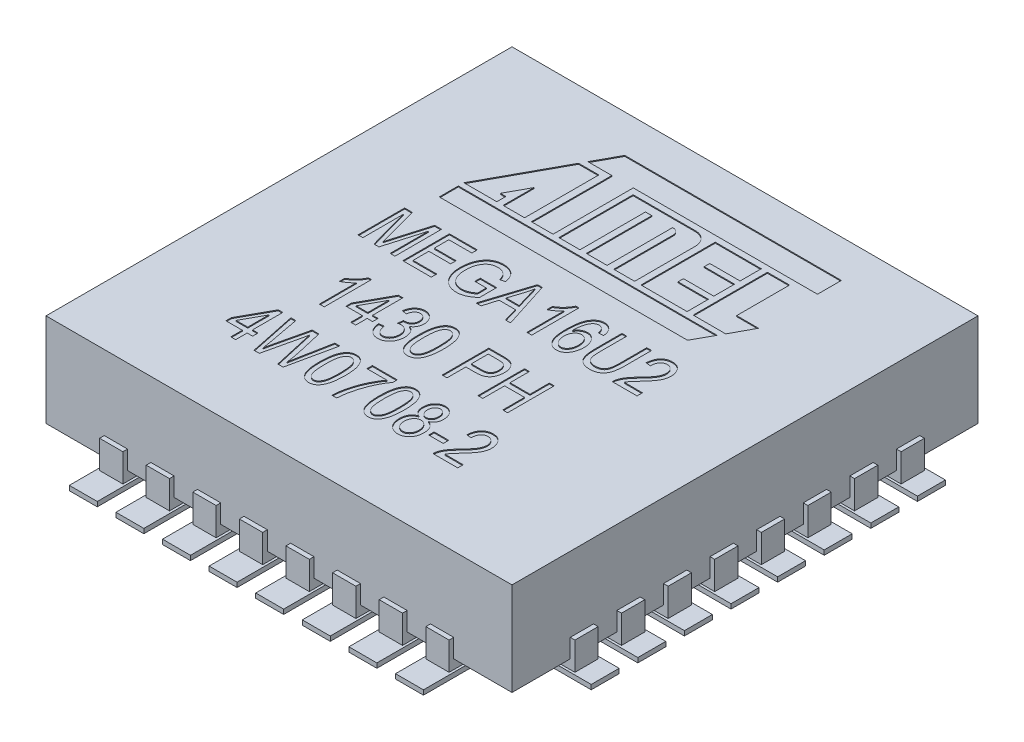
from build123d import *

# Parameters (mm, degrees)
ESQUISSE1_W             = 5
ESQUISSE1_H             = 5
BOSS_EXTRU_1_DEPTH      = 1
BOSS_EXTRU_2_DEPTH      = 0.1
BOSS_EXTRU_2_2_DEPTH    = 0.1
BOSS_EXTRU_2_3_DEPTH    = 0.1
BOSS_EXTRU_2_4_DEPTH    = 0.1
BOSS_EXTRU_2_5_DEPTH    = 0.1
BOSS_EXTRU_2_6_DEPTH    = 0.1
BOSS_EXTRU_2_7_DEPTH    = 0.1
BOSS_EXTRU_2_8_DEPTH    = 0.1
BOSS_EXTRU_2_9_DEPTH    = 0.1
BOSS_EXTRU_2_10_DEPTH   = 0.1
BOSS_EXTRU_2_11_DEPTH   = 0.1
BOSS_EXTRU_2_12_DEPTH   = 0.1
BOSS_EXTRU_2_13_DEPTH   = 0.1
BOSS_EXTRU_2_14_DEPTH   = 0.1
BOSS_EXTRU_2_15_DEPTH   = 0.1
BOSS_EXTRU_2_16_DEPTH   = 0.1
BOSS_EXTRU_2_17_DEPTH   = 0.1
BOSS_EXTRU_2_18_DEPTH   = 0.1
BOSS_EXTRU_2_19_DEPTH   = 0.1
BOSS_EXTRU_2_20_DEPTH   = 0.1
BOSS_EXTRU_2_21_DEPTH   = 0.1
BOSS_EXTRU_2_22_DEPTH   = 0.1
BOSS_EXTRU_2_23_DEPTH   = 0.1
BOSS_EXTRU_2_24_DEPTH   = 0.1
BOSS_EXTRU_2_25_DEPTH   = 0.1
BOSS_EXTRU_2_26_DEPTH   = 0.1
BOSS_EXTRU_2_27_DEPTH   = 0.1
BOSS_EXTRU_2_28_DEPTH   = 0.1
BOSS_EXTRU_2_29_DEPTH   = 0.1
BOSS_EXTRU_2_30_DEPTH   = 0.1
BOSS_EXTRU_2_31_DEPTH   = 0.1
BOSS_EXTRU_2_32_DEPTH   = 0.1
ESQUISSE3_W             = 0.25
ESQUISSE3_H             = 0.05
ESQUISSE3_W_2           = 0.05
ESQUISSE3_H_2           = 0.25
BOSS_EXTRU_3_DEPTH      = 0.2
ESQUISSE4_W             = 0.3
ESQUISSE4_H             = 0.7
BOSS_EXTRU_4_DEPTH      = 0.05
BOSS_EXTRU_4_2_DEPTH    = 0.05
BOSS_EXTRU_4_3_DEPTH    = 0.05
BOSS_EXTRU_4_4_DEPTH    = 0.05
BOSS_EXTRU_4_5_DEPTH    = 0.05
BOSS_EXTRU_4_6_DEPTH    = 0.05
BOSS_EXTRU_4_7_DEPTH    = 0.05
BOSS_EXTRU_4_8_DEPTH    = 0.05
ESQUISSE4_W_2           = 0.7
ESQUISSE4_H_2           = 0.3
BOSS_EXTRU_4_9_DEPTH    = 0.05
BOSS_EXTRU_4_10_DEPTH   = 0.05
BOSS_EXTRU_4_11_DEPTH   = 0.05
BOSS_EXTRU_4_12_DEPTH   = 0.05
BOSS_EXTRU_4_13_DEPTH   = 0.05
BOSS_EXTRU_4_14_DEPTH   = 0.05
BOSS_EXTRU_4_15_DEPTH   = 0.05
BOSS_EXTRU_4_16_DEPTH   = 0.05
BOSS_EXTRU_4_17_DEPTH   = 0.05
BOSS_EXTRU_4_18_DEPTH   = 0.05
BOSS_EXTRU_4_19_DEPTH   = 0.05
BOSS_EXTRU_4_20_DEPTH   = 0.05
BOSS_EXTRU_4_21_DEPTH   = 0.05
BOSS_EXTRU_4_22_DEPTH   = 0.05
BOSS_EXTRU_4_23_DEPTH   = 0.05
BOSS_EXTRU_4_24_DEPTH   = 0.05
BOSS_EXTRU_4_25_DEPTH   = 0.05
BOSS_EXTRU_4_26_DEPTH   = 0.05
BOSS_EXTRU_4_27_DEPTH   = 0.05
BOSS_EXTRU_4_28_DEPTH   = 0.05
BOSS_EXTRU_4_29_DEPTH   = 0.05
BOSS_EXTRU_4_30_DEPTH   = 0.05
BOSS_EXTRU_4_31_DEPTH   = 0.05
BOSS_EXTRU_4_32_DEPTH   = 0.05
BOSS_EXTRU_5_DEPTH      = 0.125
ESQUISSE6_W             = 0.155844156
ESQUISSE6_H             = 0.058441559
ENL_V_MAT_EXTRU_1_DEPTH = 0.01


with BuildPart() as part:
    # Esquisse1 → Boss.-Extru.1 (new body)
    with BuildSketch(Plane(origin=(0, 0, 0), x_dir=(1, 0, 0), z_dir=(0, 1, 0))):
        with Locations((2.5, 2.5)):
            Rectangle(ESQUISSE1_W, ESQUISSE1_H)
    extrude(amount=BOSS_EXTRU_1_DEPTH)



with BuildPart() as body_2:
    # Esquisse2 → Boss.-Extru.2 (new body)
    with BuildSketch(Plane.XZ):
        with BuildLine():
            Line((0.625, 0.05), (0.875, 0.05))
            Line((0.875, 0.05), (0.875, -0.2))
            ThreePointArc((0.875, -0.2), (0.75, -0.325), (0.625, -0.2))
            Line((0.625, -0.2), (0.625, 0.05))
        make_face()
    extrude(amount=BOSS_EXTRU_2_DEPTH)


with BuildPart() as body_3:
    # Esquisse2 → Boss.-Extru.2 2 (new body)
    with BuildSketch(Plane.XZ):
        with BuildLine():
            Line((1.125, 0.05), (1.375, 0.05))
            Line((1.375, 0.05), (1.375, -0.2))
            ThreePointArc((1.375, -0.2), (1.25, -0.325), (1.125, -0.2))
            Line((1.125, -0.2), (1.125, 0.05))
        make_face()
    extrude(amount=BOSS_EXTRU_2_2_DEPTH)


with BuildPart() as body_4:
    # Esquisse2 → Boss.-Extru.2 3 (new body)
    with BuildSketch(Plane.XZ):
        with BuildLine():
            Line((1.625, 0.05), (1.875, 0.05))
            Line((1.875, 0.05), (1.875, -0.2))
            ThreePointArc((1.875, -0.2), (1.75, -0.325), (1.625, -0.2))
            Line((1.625, -0.2), (1.625, 0.05))
        make_face()
    extrude(amount=BOSS_EXTRU_2_3_DEPTH)


with BuildPart() as body_5:
    # Esquisse2 → Boss.-Extru.2 4 (new body)
    with BuildSketch(Plane.XZ):
        with BuildLine():
            Line((2.125, 0.05), (2.375, 0.05))
            Line((2.375, 0.05), (2.375, -0.2))
            ThreePointArc((2.375, -0.2), (2.25, -0.325), (2.125, -0.2))
            Line((2.125, -0.2), (2.125, 0.05))
        make_face()
    extrude(amount=BOSS_EXTRU_2_4_DEPTH)


with BuildPart() as body_6:
    # Esquisse2 → Boss.-Extru.2 5 (new body)
    with BuildSketch(Plane.XZ):
        with BuildLine():
            Line((2.625, 0.05), (2.875, 0.05))
            Line((2.875, 0.05), (2.875, -0.2))
            ThreePointArc((2.875, -0.2), (2.75, -0.325), (2.625, -0.2))
            Line((2.625, -0.2), (2.625, 0.05))
        make_face()
    extrude(amount=BOSS_EXTRU_2_5_DEPTH)


with BuildPart() as body_7:
    # Esquisse2 → Boss.-Extru.2 6 (new body)
    with BuildSketch(Plane.XZ):
        with BuildLine():
            Line((3.125, 0.05), (3.375, 0.05))
            Line((3.375, 0.05), (3.375, -0.2))
            ThreePointArc((3.375, -0.2), (3.25, -0.325), (3.125, -0.2))
            Line((3.125, -0.2), (3.125, 0.05))
        make_face()
    extrude(amount=BOSS_EXTRU_2_6_DEPTH)


with BuildPart() as body_8:
    # Esquisse2 → Boss.-Extru.2 7 (new body)
    with BuildSketch(Plane.XZ):
        with BuildLine():
            Line((3.625, 0.05), (3.875, 0.05))
            Line((3.875, 0.05), (3.875, -0.2))
            ThreePointArc((3.875, -0.2), (3.75, -0.325), (3.625, -0.2))
            Line((3.625, -0.2), (3.625, 0.05))
        make_face()
    extrude(amount=BOSS_EXTRU_2_7_DEPTH)


with BuildPart() as body_9:
    # Esquisse2 → Boss.-Extru.2 8 (new body)
    with BuildSketch(Plane.XZ):
        with BuildLine():
            Line((4.125, 0.05), (4.375, 0.05))
            Line((4.375, 0.05), (4.375, -0.2))
            ThreePointArc((4.375, -0.2), (4.25, -0.325), (4.125, -0.2))
            Line((4.125, -0.2), (4.125, 0.05))
        make_face()
    extrude(amount=BOSS_EXTRU_2_8_DEPTH)


with BuildPart() as body_10:
    # Esquisse2 → Boss.-Extru.2 9 (new body)
    with BuildSketch(Plane.XZ):
        with BuildLine():
            Line((-0.05, -1.125), (-0.05, -1.375))
            Line((-0.05, -1.375), (0.2, -1.375))
            ThreePointArc((0.2, -1.375), (0.325, -1.25), (0.2, -1.125))
            Line((0.2, -1.125), (-0.05, -1.125))
        make_face()
    extrude(amount=BOSS_EXTRU_2_9_DEPTH)


with BuildPart() as body_11:
    # Esquisse2 → Boss.-Extru.2 10 (new body)
    with BuildSketch(Plane.XZ):
        with BuildLine():
            Line((0.2, -0.625), (-0.05, -0.625))
            Line((-0.05, -0.625), (-0.05, -0.875))
            Line((-0.05, -0.875), (0.2, -0.875))
            ThreePointArc((0.2, -0.875), (0.325, -0.75), (0.2, -0.625))
        make_face()
    extrude(amount=BOSS_EXTRU_2_10_DEPTH)


with BuildPart() as body_12:
    # Esquisse2 → Boss.-Extru.2 11 (new body)
    with BuildSketch(Plane.XZ):
        with BuildLine():
            Line((-0.05, -1.625), (-0.05, -1.875))
            Line((-0.05, -1.875), (0.2, -1.875))
            ThreePointArc((0.2, -1.875), (0.325, -1.75), (0.2, -1.625))
            Line((0.2, -1.625), (-0.05, -1.625))
        make_face()
    extrude(amount=BOSS_EXTRU_2_11_DEPTH)


with BuildPart() as body_13:
    # Esquisse2 → Boss.-Extru.2 12 (new body)
    with BuildSketch(Plane.XZ):
        with BuildLine():
            Line((-0.05, -2.125), (-0.05, -2.375))
            Line((-0.05, -2.375), (0.2, -2.375))
            ThreePointArc((0.2, -2.375), (0.325, -2.25), (0.2, -2.125))
            Line((0.2, -2.125), (-0.05, -2.125))
        make_face()
    extrude(amount=BOSS_EXTRU_2_12_DEPTH)


with BuildPart() as body_14:
    # Esquisse2 → Boss.-Extru.2 13 (new body)
    with BuildSketch(Plane.XZ):
        with BuildLine():
            Line((-0.05, -2.625), (-0.05, -2.875))
            Line((-0.05, -2.875), (0.2, -2.875))
            ThreePointArc((0.2, -2.875), (0.325, -2.75), (0.2, -2.625))
            Line((0.2, -2.625), (-0.05, -2.625))
        make_face()
    extrude(amount=BOSS_EXTRU_2_13_DEPTH)


with BuildPart() as body_15:
    # Esquisse2 → Boss.-Extru.2 14 (new body)
    with BuildSketch(Plane.XZ):
        with BuildLine():
            Line((-0.05, -3.125), (-0.05, -3.375))
            Line((-0.05, -3.375), (0.2, -3.375))
            ThreePointArc((0.2, -3.375), (0.325, -3.25), (0.2, -3.125))
            Line((0.2, -3.125), (-0.05, -3.125))
        make_face()
    extrude(amount=BOSS_EXTRU_2_14_DEPTH)


with BuildPart() as body_16:
    # Esquisse2 → Boss.-Extru.2 15 (new body)
    with BuildSketch(Plane.XZ):
        with BuildLine():
            Line((-0.05, -3.625), (-0.05, -3.875))
            Line((-0.05, -3.875), (0.2, -3.875))
            ThreePointArc((0.2, -3.875), (0.325, -3.75), (0.2, -3.625))
            Line((0.2, -3.625), (-0.05, -3.625))
        make_face()
    extrude(amount=BOSS_EXTRU_2_15_DEPTH)


with BuildPart() as body_17:
    # Esquisse2 → Boss.-Extru.2 16 (new body)
    with BuildSketch(Plane.XZ):
        with BuildLine():
            Line((-0.05, -4.125), (-0.05, -4.375))
            Line((-0.05, -4.375), (0.2, -4.375))
            ThreePointArc((0.2, -4.375), (0.325, -4.25), (0.2, -4.125))
            Line((0.2, -4.125), (-0.05, -4.125))
        make_face()
    extrude(amount=BOSS_EXTRU_2_16_DEPTH)


with BuildPart() as body_18:
    # Esquisse2 → Boss.-Extru.2 17 (new body)
    with BuildSketch(Plane.XZ):
        with BuildLine():
            Line((0.625, -5.05), (0.625, -4.8))
            ThreePointArc((0.625, -4.8), (0.75, -4.675), (0.875, -4.8))
            Line((0.875, -4.8), (0.875, -5.05))
            Line((0.875, -5.05), (0.625, -5.05))
        make_face()
    extrude(amount=BOSS_EXTRU_2_17_DEPTH)


with BuildPart() as body_19:
    # Esquisse2 → Boss.-Extru.2 18 (new body)
    with BuildSketch(Plane.XZ):
        with BuildLine():
            Line((1.125, -5.05), (1.375, -5.05))
            Line((1.375, -5.05), (1.375, -4.8))
            ThreePointArc((1.375, -4.8), (1.25, -4.675), (1.125, -4.8))
            Line((1.125, -4.8), (1.125, -5.05))
        make_face()
    extrude(amount=BOSS_EXTRU_2_18_DEPTH)


with BuildPart() as body_20:
    # Esquisse2 → Boss.-Extru.2 19 (new body)
    with BuildSketch(Plane.XZ):
        with BuildLine():
            Line((1.625, -5.05), (1.875, -5.05))
            Line((1.875, -5.05), (1.875, -4.8))
            ThreePointArc((1.875, -4.8), (1.75, -4.675), (1.625, -4.8))
            Line((1.625, -4.8), (1.625, -5.05))
        make_face()
    extrude(amount=BOSS_EXTRU_2_19_DEPTH)


with BuildPart() as body_21:
    # Esquisse2 → Boss.-Extru.2 20 (new body)
    with BuildSketch(Plane.XZ):
        with BuildLine():
            Line((2.125, -5.05), (2.375, -5.05))
            Line((2.375, -5.05), (2.375, -4.8))
            ThreePointArc((2.375, -4.8), (2.25, -4.675), (2.125, -4.8))
            Line((2.125, -4.8), (2.125, -5.05))
        make_face()
    extrude(amount=BOSS_EXTRU_2_20_DEPTH)


with BuildPart() as body_22:
    # Esquisse2 → Boss.-Extru.2 21 (new body)
    with BuildSketch(Plane.XZ):
        with BuildLine():
            Line((2.625, -5.05), (2.875, -5.05))
            Line((2.875, -5.05), (2.875, -4.8))
            ThreePointArc((2.875, -4.8), (2.75, -4.675), (2.625, -4.8))
            Line((2.625, -4.8), (2.625, -5.05))
        make_face()
    extrude(amount=BOSS_EXTRU_2_21_DEPTH)


with BuildPart() as body_23:
    # Esquisse2 → Boss.-Extru.2 22 (new body)
    with BuildSketch(Plane.XZ):
        with BuildLine():
            Line((3.125, -5.05), (3.375, -5.05))
            Line((3.375, -5.05), (3.375, -4.8))
            ThreePointArc((3.375, -4.8), (3.25, -4.675), (3.125, -4.8))
            Line((3.125, -4.8), (3.125, -5.05))
        make_face()
    extrude(amount=BOSS_EXTRU_2_22_DEPTH)


with BuildPart() as body_24:
    # Esquisse2 → Boss.-Extru.2 23 (new body)
    with BuildSketch(Plane.XZ):
        with BuildLine():
            Line((3.625, -5.05), (3.875, -5.05))
            Line((3.875, -5.05), (3.875, -4.8))
            ThreePointArc((3.875, -4.8), (3.75, -4.675), (3.625, -4.8))
            Line((3.625, -4.8), (3.625, -5.05))
        make_face()
    extrude(amount=BOSS_EXTRU_2_23_DEPTH)


with BuildPart() as body_25:
    # Esquisse2 → Boss.-Extru.2 24 (new body)
    with BuildSketch(Plane.XZ):
        with BuildLine():
            Line((4.125, -5.05), (4.375, -5.05))
            Line((4.375, -5.05), (4.375, -4.8))
            ThreePointArc((4.375, -4.8), (4.25, -4.675), (4.125, -4.8))
            Line((4.125, -4.8), (4.125, -5.05))
        make_face()
    extrude(amount=BOSS_EXTRU_2_24_DEPTH)


with BuildPart() as body_26:
    # Esquisse2 → Boss.-Extru.2 25 (new body)
    with BuildSketch(Plane.XZ):
        with BuildLine():
            Line((4.8, -4.375), (5.05, -4.375))
            Line((5.05, -4.375), (5.05, -4.125))
            Line((5.05, -4.125), (4.8, -4.125))
            ThreePointArc((4.8, -4.125), (4.675, -4.25), (4.8, -4.375))
        make_face()
    extrude(amount=BOSS_EXTRU_2_25_DEPTH)


with BuildPart() as body_27:
    # Esquisse2 → Boss.-Extru.2 26 (new body)
    with BuildSketch(Plane.XZ):
        with BuildLine():
            Line((4.8, -3.875), (5.05, -3.875))
            Line((5.05, -3.875), (5.05, -3.625))
            Line((5.05, -3.625), (4.8, -3.625))
            ThreePointArc((4.8, -3.625), (4.675, -3.75), (4.8, -3.875))
        make_face()
    extrude(amount=BOSS_EXTRU_2_26_DEPTH)


with BuildPart() as body_28:
    # Esquisse2 → Boss.-Extru.2 27 (new body)
    with BuildSketch(Plane.XZ):
        with BuildLine():
            Line((4.8, -3.375), (5.05, -3.375))
            Line((5.05, -3.375), (5.05, -3.125))
            Line((5.05, -3.125), (4.8, -3.125))
            ThreePointArc((4.8, -3.125), (4.675, -3.25), (4.8, -3.375))
        make_face()
    extrude(amount=BOSS_EXTRU_2_27_DEPTH)


with BuildPart() as body_29:
    # Esquisse2 → Boss.-Extru.2 28 (new body)
    with BuildSketch(Plane.XZ):
        with BuildLine():
            Line((4.8, -2.875), (5.05, -2.875))
            Line((5.05, -2.875), (5.05, -2.625))
            Line((5.05, -2.625), (4.8, -2.625))
            ThreePointArc((4.8, -2.625), (4.675, -2.75), (4.8, -2.875))
        make_face()
    extrude(amount=BOSS_EXTRU_2_28_DEPTH)


with BuildPart() as body_30:
    # Esquisse2 → Boss.-Extru.2 29 (new body)
    with BuildSketch(Plane.XZ):
        with BuildLine():
            Line((4.8, -2.375), (5.05, -2.375))
            Line((5.05, -2.375), (5.05, -2.125))
            Line((5.05, -2.125), (4.8, -2.125))
            ThreePointArc((4.8, -2.125), (4.675, -2.25), (4.8, -2.375))
        make_face()
    extrude(amount=BOSS_EXTRU_2_29_DEPTH)


with BuildPart() as body_31:
    # Esquisse2 → Boss.-Extru.2 30 (new body)
    with BuildSketch(Plane.XZ):
        with BuildLine():
            Line((4.8, -1.875), (5.05, -1.875))
            Line((5.05, -1.875), (5.05, -1.625))
            Line((5.05, -1.625), (4.8, -1.625))
            ThreePointArc((4.8, -1.625), (4.675, -1.75), (4.8, -1.875))
        make_face()
    extrude(amount=BOSS_EXTRU_2_30_DEPTH)


with BuildPart() as body_32:
    # Esquisse2 → Boss.-Extru.2 31 (new body)
    with BuildSketch(Plane.XZ):
        with BuildLine():
            Line((4.8, -1.375), (5.05, -1.375))
            Line((5.05, -1.375), (5.05, -1.125))
            Line((5.05, -1.125), (4.8, -1.125))
            ThreePointArc((4.8, -1.125), (4.675, -1.25), (4.8, -1.375))
        make_face()
    extrude(amount=BOSS_EXTRU_2_31_DEPTH)


with BuildPart() as body_33:
    # Esquisse2 → Boss.-Extru.2 32 (new body)
    with BuildSketch(Plane.XZ):
        with BuildLine():
            Line((4.8, -0.875), (5.05, -0.875))
            Line((5.05, -0.875), (5.05, -0.625))
            Line((5.05, -0.625), (4.8, -0.625))
            ThreePointArc((4.8, -0.625), (4.675, -0.75), (4.8, -0.875))
        make_face()
    extrude(amount=BOSS_EXTRU_2_32_DEPTH)


with BuildPart() as part_1:
    add(part.part)

    add(body_2.part)  # Boss.-Extru.3 merges body 2

    add(body_3.part)  # Boss.-Extru.3 merges body 3

    add(body_4.part)  # Boss.-Extru.3 merges body 4

    add(body_5.part)  # Boss.-Extru.3 merges body 5

    add(body_6.part)  # Boss.-Extru.3 merges body 6

    add(body_7.part)  # Boss.-Extru.3 merges body 7

    add(body_8.part)  # Boss.-Extru.3 merges body 8

    add(body_9.part)  # Boss.-Extru.3 merges body 9

    add(body_10.part)  # Boss.-Extru.3 merges body 10

    add(body_11.part)  # Boss.-Extru.3 merges body 11

    add(body_12.part)  # Boss.-Extru.3 merges body 12

    add(body_13.part)  # Boss.-Extru.3 merges body 13

    add(body_14.part)  # Boss.-Extru.3 merges body 14

    add(body_15.part)  # Boss.-Extru.3 merges body 15

    add(body_16.part)  # Boss.-Extru.3 merges body 16

    add(body_17.part)  # Boss.-Extru.3 merges body 17

    add(body_18.part)  # Boss.-Extru.3 merges body 18

    add(body_19.part)  # Boss.-Extru.3 merges body 19

    add(body_20.part)  # Boss.-Extru.3 merges body 20

    add(body_21.part)  # Boss.-Extru.3 merges body 21

    add(body_22.part)  # Boss.-Extru.3 merges body 22

    add(body_23.part)  # Boss.-Extru.3 merges body 23

    add(body_24.part)  # Boss.-Extru.3 merges body 24

    add(body_25.part)  # Boss.-Extru.3 merges body 25

    add(body_26.part)  # Boss.-Extru.3 merges body 26

    add(body_27.part)  # Boss.-Extru.3 merges body 27

    add(body_28.part)  # Boss.-Extru.3 merges body 28

    add(body_29.part)  # Boss.-Extru.3 merges body 29

    add(body_30.part)  # Boss.-Extru.3 merges body 30

    add(body_31.part)  # Boss.-Extru.3 merges body 31

    add(body_32.part)  # Boss.-Extru.3 merges body 32

    add(body_33.part)  # Boss.-Extru.3 merges body 33
    # Esquisse3 → Boss.-Extru.3 (add)
    with BuildSketch(Plane(origin=(0, 0, 0), x_dir=(1, 0, 0), z_dir=(0, 1, 0))):
        with Locations((0.75, 5.025)):
            Rectangle(ESQUISSE3_W, ESQUISSE3_H)
        with Locations((1.25, 5.025)):
            Rectangle(ESQUISSE3_W, ESQUISSE3_H)
        with Locations((1.75, 5.025)):
            Rectangle(ESQUISSE3_W, ESQUISSE3_H)
        with Locations((2.25, 5.025)):
            Rectangle(ESQUISSE3_W, ESQUISSE3_H)
        with Locations((2.75, 5.025)):
            Rectangle(ESQUISSE3_W, ESQUISSE3_H)
        with Locations((3.25, 5.025)):
            Rectangle(ESQUISSE3_W, ESQUISSE3_H)
        with Locations((3.75, 5.025)):
            Rectangle(ESQUISSE3_W, ESQUISSE3_H)
        with Locations((4.25, 5.025)):
            Rectangle(ESQUISSE3_W, ESQUISSE3_H)
        with Locations((5.025, 4.25)):
            Rectangle(ESQUISSE3_W_2, ESQUISSE3_H_2)
        with Locations((5.025, 3.75)):
            Rectangle(ESQUISSE3_W_2, ESQUISSE3_H_2)
        with Locations((5.025, 3.25)):
            Rectangle(ESQUISSE3_W_2, ESQUISSE3_H_2)
        with Locations((5.025, 2.75)):
            Rectangle(ESQUISSE3_W_2, ESQUISSE3_H_2)
        with Locations((5.025, 2.25)):
            Rectangle(ESQUISSE3_W_2, ESQUISSE3_H_2)
        with Locations((5.025, 1.75)):
            Rectangle(ESQUISSE3_W_2, ESQUISSE3_H_2)
        with Locations((5.025, 1.25)):
            Rectangle(ESQUISSE3_W_2, ESQUISSE3_H_2)
        with Locations((5.025, 0.75)):
            Rectangle(ESQUISSE3_W_2, ESQUISSE3_H_2)
        with Locations((4.25, -0.025)):
            Rectangle(ESQUISSE3_W, ESQUISSE3_H)
        with Locations((3.75, -0.025)):
            Rectangle(ESQUISSE3_W, ESQUISSE3_H)
        with Locations((3.25, -0.025)):
            Rectangle(ESQUISSE3_W, ESQUISSE3_H)
        with Locations((2.75, -0.025)):
            Rectangle(ESQUISSE3_W, ESQUISSE3_H)
        with Locations((2.25, -0.025)):
            Rectangle(ESQUISSE3_W, ESQUISSE3_H)
        with Locations((1.75, -0.025)):
            Rectangle(ESQUISSE3_W, ESQUISSE3_H)
        with Locations((1.25, -0.025)):
            Rectangle(ESQUISSE3_W, ESQUISSE3_H)
        with Locations((0.75, -0.025)):
            Rectangle(ESQUISSE3_W, ESQUISSE3_H)
        with Locations((-0.025, 0.75)):
            Rectangle(ESQUISSE3_W_2, ESQUISSE3_H_2)
        with Locations((-0.025, 1.25)):
            Rectangle(ESQUISSE3_W_2, ESQUISSE3_H_2)
        with Locations((-0.025, 1.75)):
            Rectangle(ESQUISSE3_W_2, ESQUISSE3_H_2)
        with Locations((-0.025, 2.25)):
            Rectangle(ESQUISSE3_W_2, ESQUISSE3_H_2)
        with Locations((-0.025, 2.75)):
            Rectangle(ESQUISSE3_W_2, ESQUISSE3_H_2)
        with Locations((-0.025, 3.25)):
            Rectangle(ESQUISSE3_W_2, ESQUISSE3_H_2)
        with Locations((-0.025, 3.75)):
            Rectangle(ESQUISSE3_W_2, ESQUISSE3_H_2)
        with Locations((-0.025, 4.25)):
            Rectangle(ESQUISSE3_W_2, ESQUISSE3_H_2)
    extrude(amount=BOSS_EXTRU_3_DEPTH)

    # Esquisse5 → Boss.-Extru.5 (add)
    with BuildSketch(Plane.XZ):
        with BuildLine():
            Line((0.9, -0.7), (4.1, -0.7))
            ThreePointArc((4.1, -0.7), (4.241421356, -0.758578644), (4.3, -0.9))
            Line((4.3, -0.9), (4.3, -4.1))
            ThreePointArc((4.3, -4.1), (4.241421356, -4.241421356), (4.1, -4.3))
            Line((4.1, -4.3), (0.9, -4.3))
            ThreePointArc((0.9, -4.3), (0.758578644, -4.241421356), (0.7, -4.1))
            Line((0.7, -4.1), (0.7, -0.9))
            ThreePointArc((0.7, -0.9), (0.758578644, -0.758578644), (0.9, -0.7))
        make_face()
    extrude(amount=BOSS_EXTRU_5_DEPTH)

    # Esquisse6 → Enl_v. mat.-Extru.1 (cut)
    # profile 1 of 28: a face of its own
    with BuildSketch(Plane(origin=(0, 1, 0), x_dir=(1, 0, 0), z_dir=(0, 1, 0))):
        Polygon((1.00479915, 3.214847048), (1.00479915, 3.419395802), (3.781250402, 3.419395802), (3.668187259, 3.214847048), align=None)
    # profile 2 of 28: a face of its own
    with BuildSketch(Plane(origin=(0, 1, 0), x_dir=(1, 0, 0), z_dir=(0, 1, 0))):
        Polygon((1.00479915, 3.478876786), (1.438945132, 4.275287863), (1.656287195, 4.275287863), (1.656287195, 3.478876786), (1.426033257, 3.478876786), (1.426033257, 3.809118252), (1.299054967, 3.576185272), (1.358043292, 3.576185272), (1.358043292, 3.478876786), align=None)
    # profile 3 of 28: a face of its own
    with BuildSketch(Plane(origin=(0, 1, 0), x_dir=(1, 0, 0), z_dir=(0, 1, 0))):
        Polygon((1.474058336, 4.339700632), (1.613887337, 4.596207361), (3.937956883, 4.596207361), (3.937956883, 4.339700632), (1.961543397, 4.339700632), (1.961543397, 3.478876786), (1.729340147, 3.478876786), (1.731867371, 4.339700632), align=None)
    # profile 4 of 28: a face of its own
    with BuildSketch(Plane(origin=(0, 1, 0), x_dir=(1, 0, 0), z_dir=(0, 1, 0))):
        with BuildLine():
            Line((2.024329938, 3.478876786), (2.024329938, 4.275287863))
            Line((2.024329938, 4.275287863), (2.695486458, 4.275287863))
            ThreePointArc((2.695486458, 4.275287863), (2.795510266, 4.233856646), (2.836941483, 4.133832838))
            Line((2.836941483, 4.133832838), (2.836941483, 3.478870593))
            Line((2.836941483, 3.478870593), (2.613491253, 3.478870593))
            Line((2.613491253, 3.478870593), (2.613491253, 4.122816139))
            ThreePointArc((2.613491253, 4.122816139), (2.589597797, 4.16686802), (2.541553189, 4.181122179))
            Line((2.541553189, 4.181122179), (2.541553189, 3.478876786))
            Line((2.541553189, 3.478876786), (2.318788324, 3.478876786))
            Line((2.318788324, 3.478876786), (2.318788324, 4.181122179))
            Line((2.318788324, 4.181122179), (2.250663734, 4.181122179))
            Line((2.250663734, 4.181122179), (2.250663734, 3.478876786))
            Line((2.250663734, 3.478876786), (2.024329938, 3.478876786))
        make_face()
    # profile 5 of 28: a face of its own
    with BuildSketch(Plane(origin=(0, 1, 0), x_dir=(1, 0, 0), z_dir=(0, 1, 0))):
        Polygon((2.905192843, 3.478870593), (3.399642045, 3.478870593), (3.399642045, 3.707591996), (3.074404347, 3.707591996), (3.074404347, 3.765277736), (3.399642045, 3.765277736), (3.399642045, 3.988305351), (3.074404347, 3.988305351), (3.074404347, 4.047581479), (3.399642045, 4.047581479), (3.399642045, 4.275287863), (2.905192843, 4.275287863), align=None)
    # profile 6 of 28: a face of its own
    with BuildSketch(Plane(origin=(0, 1, 0), x_dir=(1, 0, 0), z_dir=(0, 1, 0))):
        Polygon((3.464933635, 3.478870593), (3.814235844, 3.478870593), (3.937956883, 3.707591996), (3.703012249, 3.707591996), (3.703012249, 4.275287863), (3.464933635, 4.275287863), align=None)
    # profile 7 of 28: a face of its own
    with BuildSketch(Plane(origin=(0, 1, 0), x_dir=(1, 0, 0), z_dir=(0, 1, 0))):
        with BuildLine():
            Line((0.921442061, 2.426670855), (0.921442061, 2.926670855))
            Line((0.921442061, 2.926670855), (1.002712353, 2.926670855))
            Line((1.002712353, 2.926670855), (1.10001349, 2.57267329))
            Line((1.10001349, 2.57267329), (1.119494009, 2.498606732))
            add(Edge.make_bspline(
                [(1.119494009, 2.498606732), (1.120129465, 2.501043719), (1.121464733, 2.506164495), (1.12373035, 2.514238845), (1.126286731, 2.523075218), (1.128864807, 2.532749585), (1.13184141, 2.543123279), (1.135104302, 2.55426946), (1.1385484, 2.566243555), (1.140903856, 2.574499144), (1.142119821, 2.578760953)],
                knots=[0, 0, 0, 0, 0.72569615, 1.52488642, 2.416426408, 3.376296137, 4.409732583, 5.526177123, 6.722930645, 8, 8, 8, 8], degree=3))
            Line((1.142119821, 2.578760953), (1.243986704, 2.926670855))
            Line((1.243986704, 2.926670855), (1.317545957, 2.926670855))
            Line((1.317545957, 2.926670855), (1.317545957, 2.426670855))
            Line((1.317545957, 2.426670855), (1.265597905, 2.426670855))
            Line((1.265597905, 2.426670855), (1.265597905, 2.839414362))
            Line((1.265597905, 2.839414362), (1.145569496, 2.426670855))
            Line((1.145569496, 2.426670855), (1.092403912, 2.426670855))
            Line((1.092403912, 2.426670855), (0.973390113, 2.863054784))
            Line((0.973390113, 2.863054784), (0.973390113, 2.426670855))
            Line((0.973390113, 2.426670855), (0.921442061, 2.426670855))
        make_face()
    # profile 8 of 28: a face of its own
    with BuildSketch(Plane(origin=(0, 1, 0), x_dir=(1, 0, 0), z_dir=(0, 1, 0))):
        Polygon((1.401961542, 2.426670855), (1.401961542, 2.926670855), (1.70066284, 2.926670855), (1.70066284, 2.868229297), (1.453909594, 2.868229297), (1.453909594, 2.712385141), (1.687675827, 2.712385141), (1.687675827, 2.653943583), (1.453909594, 2.653943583), (1.453909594, 2.485112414), (1.707156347, 2.485112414), (1.707156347, 2.426670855), align=None)
    # profile 9 of 28: a face of its own
    with BuildSketch(Plane(origin=(0, 1, 0), x_dir=(1, 0, 0), z_dir=(0, 1, 0))):
        with BuildLine():
            Line((1.97988362, 2.62147605), (1.97988362, 2.679917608))
            Line((1.97988362, 2.679917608), (2.155208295, 2.679917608))
            Line((2.155208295, 2.679917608), (2.155208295, 2.496780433))
            add(Edge.make_bspline(
                [(2.155208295, 2.496780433), (2.148540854, 2.490713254), (2.135491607, 2.478838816), (2.114693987, 2.463335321), (2.09363767, 2.450008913), (2.072209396, 2.43912087), (2.050447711, 2.430569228), (2.028366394, 2.424598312), (2.005948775, 2.420893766), (1.990889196, 2.420416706), (1.983333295, 2.420177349)],
                knots=[0, 0, 0, 0, 1.121144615, 2.194259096, 3.22291754, 4.218514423, 5.180530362, 6.126881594, 7.060193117, 8, 8, 8, 8], degree=3))
            add(Edge.make_bspline(
                [(1.983333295, 2.420177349), (1.978359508, 2.420292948), (1.968496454, 2.420522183), (1.953907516, 2.42179819), (1.939713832, 2.424182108), (1.925944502, 2.427402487), (1.912557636, 2.431546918), (1.899670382, 2.436822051), (1.887042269, 2.442717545), (1.874969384, 2.449777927), (1.863406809, 2.457678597), (1.852430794, 2.466438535), (1.842019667, 2.47596839), (1.832362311, 2.486522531), (1.82328188, 2.497866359), (1.814663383, 2.509961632), (1.806900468, 2.523057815), (1.799558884, 2.536884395), (1.793105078, 2.551573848), (1.787497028, 2.566999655), (1.78275819, 2.583137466), (1.778782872, 2.59999669), (1.775745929, 2.617582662), (1.773673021, 2.635878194), (1.772284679, 2.654869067), (1.772156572, 2.667773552), (1.772091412, 2.674337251)],
                knots=[0, 0, 0, 0, 0.963545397, 1.910717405, 2.833679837, 3.748938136, 4.648160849, 5.544707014, 6.44428759, 7.345417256, 8.250301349, 9.15471106, 10.063381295, 10.981308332, 11.922549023, 12.876762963, 13.855312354, 14.869185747, 15.907484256, 16.960251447, 18.046404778, 19.163470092, 20.313696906, 21.500864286, 22.728847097, 24, 24, 24, 24], degree=3))
            add(Edge.make_bspline(
                [(1.772091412, 2.674337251), (1.77215932, 2.681002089), (1.772292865, 2.694108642), (1.773645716, 2.71344504), (1.775868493, 2.732099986), (1.778929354, 2.750110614), (1.782714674, 2.767523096), (1.787631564, 2.784231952), (1.793287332, 2.800302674), (1.799813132, 2.815626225), (1.806941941, 2.830188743), (1.814781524, 2.843783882), (1.823070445, 2.856452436), (1.832070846, 2.867986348), (1.841364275, 2.878749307), (1.851349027, 2.888377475), (1.861824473, 2.897087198), (1.872942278, 2.904679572), (1.884532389, 2.911415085), (1.896669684, 2.917187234), (1.909263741, 2.922183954), (1.922378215, 2.926275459), (1.936040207, 2.929265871), (1.950201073, 2.931488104), (1.964868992, 2.932990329), (1.974840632, 2.933105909), (1.97988362, 2.933164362)],
                knots=[0, 0, 0, 0, 1.283121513, 2.523287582, 3.730023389, 4.899079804, 6.039789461, 7.15880579, 8.250410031, 9.318392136, 10.363902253, 11.370311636, 12.338384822, 13.276198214, 14.185288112, 15.074093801, 15.943727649, 16.805327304, 17.663128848, 18.522362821, 19.39060582, 20.270106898, 21.164311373, 22.080741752, 23.02936765, 24, 24, 24, 24], degree=3))
            add(Edge.make_bspline(
                [(1.97988362, 2.933164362), (1.987234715, 2.932989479), (2.001534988, 2.932649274), (2.02226794, 2.929437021), (2.041606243, 2.924207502), (2.059475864, 2.916733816), (2.075880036, 2.907364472), (2.090814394, 2.89623153), (2.104237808, 2.883337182), (2.11405407, 2.871097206), (2.121168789, 2.860391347), (2.126169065, 2.851569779), (2.130828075, 2.842056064), (2.135061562, 2.831764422), (2.139011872, 2.82079287), (2.14267828, 2.80912645), (2.145906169, 2.796721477), (2.147763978, 2.788183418), (2.148714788, 2.783813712)],
                knots=[0, 0, 0, 0, 1.421442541, 2.765168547, 4.047841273, 5.288586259, 6.501956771, 7.694182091, 8.88353085, 10.093491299, 10.721426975, 11.369099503, 12.053886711, 12.769643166, 13.521004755, 14.309514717, 15.134823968, 16, 16, 16, 16], degree=3))
            Line((2.148714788, 2.783813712), (2.096766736, 2.770826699))
            add(Edge.make_bspline(
                [(2.096766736, 2.770826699), (2.095070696, 2.777213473), (2.091877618, 2.789237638), (2.085914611, 2.805805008), (2.079275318, 2.819814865), (2.071852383, 2.831558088), (2.063323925, 2.841333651), (2.053877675, 2.849985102), (2.042971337, 2.857217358), (2.031132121, 2.863580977), (2.018218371, 2.868469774), (2.004543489, 2.872195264), (1.99002923, 2.874329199), (1.980093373, 2.874589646), (1.97501349, 2.874722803)],
                knots=[0, 0, 0, 0, 1.35370667, 2.548578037, 3.602482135, 4.525244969, 5.385205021, 6.25372376, 7.141792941, 8.059466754, 9.00287123, 9.96447941, 10.959304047, 12, 12, 12, 12], degree=3))
            add(Edge.make_bspline(
                [(1.97501349, 2.874722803), (1.971290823, 2.874674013), (1.96396627, 2.874578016), (1.953151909, 2.873529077), (1.942746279, 2.871824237), (1.932726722, 2.869443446), (1.923066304, 2.866603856), (1.913902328, 2.862735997), (1.905067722, 2.858408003), (1.896600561, 2.853419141), (1.888524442, 2.847721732), (1.880934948, 2.841184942), (1.873696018, 2.834000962), (1.866986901, 2.82594163), (1.860481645, 2.817303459), (1.854519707, 2.807797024), (1.848904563, 2.7976124), (1.843777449, 2.786691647), (1.839075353, 2.775095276), (1.835029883, 2.762862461), (1.831723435, 2.749962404), (1.828823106, 2.736507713), (1.826789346, 2.722361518), (1.825093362, 2.707617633), (1.824219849, 2.692238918), (1.824100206, 2.681778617), (1.824039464, 2.676467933)],
                knots=[0, 0, 0, 0, 0.95244652, 1.873991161, 2.777557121, 3.648832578, 4.508552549, 5.350797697, 6.190771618, 7.02501797, 7.86316154, 8.7165405, 9.585620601, 10.469996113, 11.397859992, 12.351132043, 13.338946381, 14.372712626, 15.436726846, 16.539770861, 17.66713286, 18.84353329, 20.060284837, 21.322933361, 22.640856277, 24, 24, 24, 24], degree=3))
            add(Edge.make_bspline(
                [(1.824039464, 2.676467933), (1.824173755, 2.668481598), (1.82443426, 2.652989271), (1.826496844, 2.630517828), (1.8297591, 2.609538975), (1.834511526, 2.590120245), (1.84059594, 2.572245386), (1.847987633, 2.555880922), (1.856821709, 2.541089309), (1.867040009, 2.527931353), (1.87833438, 2.516363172), (1.890461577, 2.506247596), (1.903391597, 2.497634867), (1.917234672, 2.490745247), (1.931787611, 2.48518776), (1.947217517, 2.481350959), (1.963448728, 2.479114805), (1.974532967, 2.478786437), (1.980188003, 2.478618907)],
                knots=[0, 0, 0, 0, 1.344305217, 2.607756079, 3.795613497, 4.915552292, 5.968887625, 6.970219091, 7.933010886, 8.862341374, 9.768284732, 10.649651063, 11.516609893, 12.377263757, 13.247581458, 14.134137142, 15.048060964, 16, 16, 16, 16], degree=3))
            add(Edge.make_bspline(
                [(1.980188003, 2.478618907), (1.985745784, 2.478794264), (1.997033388, 2.479150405), (2.014012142, 2.482124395), (2.031146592, 2.486958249), (2.04809826, 2.493476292), (2.064255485, 2.501268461), (2.079060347, 2.50983928), (2.09206626, 2.519259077), (2.099606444, 2.526329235), (2.103260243, 2.529755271)],
                knots=[0, 0, 0, 0, 0.978162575, 1.986604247, 3.025534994, 4.109442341, 5.180230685, 6.181206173, 7.118654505, 8, 8, 8, 8], degree=3))
            Line((2.103260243, 2.529755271), (2.103260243, 2.62147605))
            Line((2.103260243, 2.62147605), (1.97988362, 2.62147605))
        make_face()
    # profile 10 of 28: a face of its own
    with BuildSketch(Plane(origin=(0, 1, 0), x_dir=(1, 0, 0), z_dir=(0, 1, 0))):
        Polygon((2.187675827, 2.426670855), (2.347375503, 2.926670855), (2.398004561, 2.926670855), (2.557805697, 2.426670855), (2.503828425, 2.426670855), (2.460098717, 2.576021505), (2.285382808, 2.576021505), (2.241754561, 2.426670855), align=None)
        with BuildLine():
            Line((2.302428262, 2.634463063), (2.442951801, 2.634463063))
            Line((2.442951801, 2.634463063), (2.401149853, 2.77184131))
            add(Edge.make_bspline(
                [(2.401149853, 2.77184131), (2.399586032, 2.776979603), (2.396532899, 2.787011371), (2.392209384, 2.801700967), (2.388059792, 2.815633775), (2.384515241, 2.828906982), (2.380990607, 2.841347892), (2.377950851, 2.853094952), (2.375222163, 2.864089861), (2.373545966, 2.871203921), (2.372740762, 2.874621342)],
                knots=[0, 0, 0, 0, 1.20859176, 2.359599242, 3.445754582, 4.479676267, 5.450859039, 6.355343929, 7.209947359, 8, 8, 8, 8], degree=3))
            add(Edge.make_bspline(
                [(2.372740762, 2.874621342), (2.37127897, 2.866661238), (2.368357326, 2.850751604), (2.36288082, 2.827051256), (2.356788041, 2.803393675), (2.351938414, 2.787785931), (2.349506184, 2.779958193)],
                knots=[0, 0, 0, 0, 0.995500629, 1.989678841, 2.991765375, 4, 4, 4, 4], degree=3))
            Line((2.349506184, 2.779958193), (2.302428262, 2.634463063))
        make_face(mode=Mode.SUBTRACT)
    # profile 11 of 28: a face of its own
    with BuildSketch(Plane(origin=(0, 1, 0), x_dir=(1, 0, 0), z_dir=(0, 1, 0))):
        with BuildLine():
            Line((2.785078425, 2.426670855), (2.733130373, 2.426670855))
            Line((2.733130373, 2.426670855), (2.733130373, 2.822774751))
            add(Edge.make_bspline(
                [(2.733130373, 2.822774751), (2.729940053, 2.81910242), (2.723328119, 2.811491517), (2.711850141, 2.800667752), (2.699059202, 2.789506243), (2.684897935, 2.778675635), (2.670468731, 2.768301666), (2.65621721, 2.759177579), (2.642677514, 2.751238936), (2.633594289, 2.746923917), (2.629234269, 2.744852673)],
                knots=[0, 0, 0, 0, 0.892555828, 1.849821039, 2.893015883, 4.008277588, 5.121255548, 6.154629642, 7.114207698, 8, 8, 8, 8], degree=3))
            Line((2.629234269, 2.744852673), (2.629234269, 2.803294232))
            add(Edge.make_bspline(
                [(2.629234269, 2.803294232), (2.636241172, 2.807511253), (2.650194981, 2.815909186), (2.669746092, 2.830457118), (2.688215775, 2.846159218), (2.705051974, 2.86318001), (2.720126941, 2.880725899), (2.733066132, 2.898236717), (2.743675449, 2.915526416), (2.748879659, 2.927419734), (2.75139336, 2.933164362)],
                knots=[0, 0, 0, 0, 1.082272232, 2.155277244, 3.222407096, 4.289527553, 5.32168536, 6.282742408, 7.170542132, 8, 8, 8, 8], degree=3))
            Line((2.75139336, 2.933164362), (2.785078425, 2.933164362))
            Line((2.785078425, 2.933164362), (2.785078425, 2.426670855))
        make_face()
    # profile 12 of 28: a face of its own
    with BuildSketch(Plane(origin=(0, 1, 0), x_dir=(1, 0, 0), z_dir=(0, 1, 0))):
        with BuildLine():
            Line((3.174688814, 2.809787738), (3.122740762, 2.803294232))
            add(Edge.make_bspline(
                [(3.122740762, 2.803294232), (3.121539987, 2.809210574), (3.119291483, 2.820289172), (3.114414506, 2.835297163), (3.108980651, 2.84784529), (3.103955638, 2.854503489), (3.101636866, 2.857575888)],
                knots=[0, 0, 0, 0, 1.230211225, 2.30362229, 3.217213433, 4, 4, 4, 4], degree=3))
            add(Edge.make_bspline(
                [(3.101636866, 2.857575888), (3.099950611, 2.859473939), (3.096671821, 2.863164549), (3.091222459, 2.867945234), (3.085611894, 2.872065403), (3.079711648, 2.875457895), (3.073452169, 2.877994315), (3.066949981, 2.879809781), (3.060213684, 2.88096717), (3.055645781, 2.88113277), (3.053341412, 2.88121631)],
                knots=[0, 0, 0, 0, 1.09495211, 2.12904747, 3.12182315, 4.09596367, 5.058329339, 6.028853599, 7.005615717, 8, 8, 8, 8], degree=3))
            add(Edge.make_bspline(
                [(3.053341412, 2.88121631), (3.049771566, 2.881083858), (3.042698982, 2.880821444), (3.032435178, 2.877992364), (3.022664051, 2.873744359), (3.013522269, 2.867600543), (3.004992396, 2.859778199), (2.996892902, 2.85035111), (2.989528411, 2.839102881), (2.985253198, 2.830831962), (2.983028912, 2.82652881)],
                knots=[0, 0, 0, 0, 0.906800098, 1.796553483, 2.691003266, 3.610512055, 4.585978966, 5.630213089, 6.767058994, 8, 8, 8, 8], degree=3))
            add(Edge.make_bspline(
                [(2.983028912, 2.82652881), (2.981162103, 2.822398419), (2.977280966, 2.813811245), (2.972729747, 2.799817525), (2.968730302, 2.784480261), (2.965731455, 2.767665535), (2.963005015, 2.749547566), (2.961266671, 2.729965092), (2.960130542, 2.709016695), (2.959975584, 2.694563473), (2.959895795, 2.687121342)],
                knots=[0, 0, 0, 0, 0.763508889, 1.587351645, 2.476402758, 3.433472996, 4.464603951, 5.563935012, 6.745641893, 8, 8, 8, 8], degree=3))
            add(Edge.make_bspline(
                [(2.959895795, 2.687121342), (2.962837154, 2.692185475), (2.968560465, 2.702039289), (2.979225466, 2.714950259), (2.990660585, 2.726202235), (3.003358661, 2.735243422), (3.016762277, 2.742337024), (3.030610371, 2.747593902), (3.044912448, 2.750765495), (3.054577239, 2.7511521), (3.059429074, 2.75134618)],
                knots=[0, 0, 0, 0, 1.127907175, 2.194687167, 3.21896757, 4.214740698, 5.189497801, 6.137088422, 7.064797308, 8, 8, 8, 8], degree=3))
            add(Edge.make_bspline(
                [(3.059429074, 2.75134618), (3.063462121, 2.751205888), (3.071410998, 2.750929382), (3.083140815, 2.748836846), (3.094432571, 2.745357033), (3.105391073, 2.740571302), (3.115907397, 2.734277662), (3.126056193, 2.726674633), (3.13571011, 2.717605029), (3.145038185, 2.707464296), (3.153506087, 2.696041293), (3.160933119, 2.683596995), (3.167270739, 2.670261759), (3.172300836, 2.65591752), (3.176379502, 2.640734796), (3.179210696, 2.624575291), (3.180797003, 2.60750652), (3.181051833, 2.595809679), (3.181182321, 2.589820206)],
                knots=[0, 0, 0, 0, 0.860357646, 1.695709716, 2.533583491, 3.377064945, 4.241047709, 5.143225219, 6.077846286, 7.063889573, 8.080111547, 9.106229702, 10.152257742, 11.225204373, 12.345649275, 13.503769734, 14.721782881, 16, 16, 16, 16], degree=3))
            add(Edge.make_bspline(
                [(3.181182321, 2.589820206), (3.180975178, 2.581692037), (3.180569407, 2.565769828), (3.177168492, 2.542457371), (3.171442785, 2.52034313), (3.164953, 2.50281671), (3.158718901, 2.48967933), (3.153727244, 2.480506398), (3.148472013, 2.471985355), (3.142907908, 2.464101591), (3.136865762, 2.457038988), (3.130676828, 2.450452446), (3.124092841, 2.444576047), (3.11496749, 2.437755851), (3.102964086, 2.43070824), (3.087630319, 2.424673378), (3.071587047, 2.420858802), (3.060599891, 2.420405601), (3.055066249, 2.420177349)],
                knots=[0, 0, 0, 0, 1.657459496, 3.246784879, 4.79287916, 6.310074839, 7.050696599, 7.757650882, 8.439205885, 9.092012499, 9.723586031, 10.333538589, 10.934530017, 11.52093132, 12.655638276, 13.761218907, 14.872446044, 16, 16, 16, 16], degree=3))
            add(Edge.make_bspline(
                [(3.055066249, 2.420177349), (3.05008183, 2.420351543), (3.040278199, 2.420694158), (3.025932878, 2.423448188), (3.012211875, 2.427757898), (2.999268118, 2.434103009), (2.986818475, 2.441908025), (2.975296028, 2.451784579), (2.964351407, 2.463270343), (2.95402462, 2.476490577), (2.944737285, 2.491897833), (2.936634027, 2.509549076), (2.929864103, 2.529585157), (2.924529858, 2.551958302), (2.92015448, 2.576617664), (2.917078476, 2.603587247), (2.915267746, 2.632916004), (2.915057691, 2.65323064), (2.914948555, 2.663785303)],
                knots=[0, 0, 0, 0, 0.760819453, 1.496421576, 2.223429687, 2.951263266, 3.692179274, 4.462099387, 5.262291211, 6.1127328, 7.019077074, 8.003719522, 9.073773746, 10.244022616, 11.513769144, 12.897217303, 14.387919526, 16, 16, 16, 16], degree=3))
            add(Edge.make_bspline(
                [(2.914948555, 2.663785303), (2.915044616, 2.675490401), (2.915229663, 2.698038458), (2.917216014, 2.730567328), (2.920221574, 2.760488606), (2.924697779, 2.787790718), (2.930252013, 2.812517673), (2.937240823, 2.83461623), (2.945352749, 2.854183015), (2.955003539, 2.871091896), (2.965643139, 2.885686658), (2.976917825, 2.898347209), (2.988858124, 2.909166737), (3.00159343, 2.917988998), (3.015157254, 2.924718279), (3.029349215, 2.929677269), (3.044331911, 2.93254855), (3.054547, 2.932956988), (3.059733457, 2.933164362)],
                knots=[0, 0, 0, 0, 1.648816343, 3.176189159, 4.589499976, 5.883521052, 7.071677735, 8.156616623, 9.145117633, 10.049911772, 10.892392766, 11.685345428, 12.434380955, 13.15730553, 13.86047472, 14.561137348, 15.269453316, 16, 16, 16, 16], degree=3))
            add(Edge.make_bspline(
                [(3.059733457, 2.933164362), (3.063490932, 2.93305715), (3.070897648, 2.932845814), (3.081796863, 2.931465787), (3.092172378, 2.92886927), (3.102120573, 2.925431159), (3.11154664, 2.920926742), (3.120595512, 2.915558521), (3.128989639, 2.908957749), (3.13702474, 2.901584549), (3.144459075, 2.893265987), (3.151067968, 2.883944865), (3.156928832, 2.873767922), (3.162173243, 2.862738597), (3.166482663, 2.850761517), (3.170005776, 2.837894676), (3.172901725, 2.824179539), (3.174082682, 2.814669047), (3.174688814, 2.809787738)],
                knots=[0, 0, 0, 0, 0.965625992, 1.903437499, 2.816107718, 3.709373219, 4.603483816, 5.496241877, 6.407089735, 7.341876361, 8.295975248, 9.267838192, 10.27248647, 11.310449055, 12.401896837, 13.538363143, 14.736552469, 16, 16, 16, 16], degree=3))
        make_face()
        with BuildLine():
            add(Edge.make_bspline(
                [(2.966896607, 2.591747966), (2.966970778, 2.587348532), (2.967115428, 2.578768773), (2.968351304, 2.566220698), (2.97039132, 2.554364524), (2.973067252, 2.543094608), (2.976770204, 2.53257142), (2.981103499, 2.522601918), (2.986412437, 2.513398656), (2.992379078, 2.504866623), (2.998896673, 2.497245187), (3.005773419, 2.490574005), (3.012821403, 2.484847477), (3.020247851, 2.480252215), (3.027855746, 2.476506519), (3.035835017, 2.474012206), (3.044010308, 2.47241039), (3.049546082, 2.47222069), (3.052326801, 2.472125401)],
                knots=[0, 0, 0, 0, 1.295936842, 2.527331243, 3.710032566, 4.838610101, 5.935196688, 6.992417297, 8.036740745, 9.059547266, 10.056000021, 10.986130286, 11.879343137, 12.725347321, 13.554280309, 14.370418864, 15.181432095, 16, 16, 16, 16], degree=3))
            add(Edge.make_bspline(
                [(3.052326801, 2.472125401), (3.054801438, 2.47223202), (3.059723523, 2.472444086), (3.066982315, 2.47387024), (3.073967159, 2.476402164), (3.080821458, 2.479733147), (3.087404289, 2.484177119), (3.093863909, 2.489444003), (3.099902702, 2.495867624), (3.105932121, 2.502968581), (3.111324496, 2.511106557), (3.116286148, 2.519888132), (3.120147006, 2.52956066), (3.123579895, 2.539795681), (3.126018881, 2.550861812), (3.128027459, 2.562564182), (3.128952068, 2.575060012), (3.12913832, 2.583596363), (3.129234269, 2.587993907)],
                knots=[0, 0, 0, 0, 0.772594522, 1.536700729, 2.298102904, 3.086693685, 3.909598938, 4.772126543, 5.683120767, 6.657848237, 7.676972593, 8.726121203, 9.800678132, 10.92259173, 12.09308983, 13.334225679, 14.626713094, 16, 16, 16, 16], degree=3))
            add(Edge.make_bspline(
                [(3.129234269, 2.587993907), (3.129141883, 2.592290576), (3.128962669, 2.600625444), (3.127991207, 2.612805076), (3.126152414, 2.624225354), (3.12368781, 2.634947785), (3.120259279, 2.644815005), (3.116360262, 2.654047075), (3.111551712, 2.662493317), (3.106078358, 2.670179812), (3.100148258, 2.677063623), (3.093765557, 2.683020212), (3.087130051, 2.688103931), (3.080092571, 2.692210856), (3.072808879, 2.69552358), (3.065070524, 2.697699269), (3.057088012, 2.699222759), (3.051623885, 2.699339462), (3.048877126, 2.699398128)],
                knots=[0, 0, 0, 0, 1.343777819, 2.606719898, 3.816838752, 4.958326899, 6.041908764, 7.079242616, 8.08798765, 9.073968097, 10.026073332, 10.923948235, 11.799625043, 12.633965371, 13.467232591, 14.293828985, 15.142325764, 16, 16, 16, 16], degree=3))
            add(Edge.make_bspline(
                [(3.048877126, 2.699398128), (3.046163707, 2.699341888), (3.040799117, 2.699230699), (3.032955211, 2.697686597), (3.025320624, 2.695510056), (3.018025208, 2.692165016), (3.010879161, 2.688127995), (3.004011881, 2.683112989), (2.997573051, 2.677040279), (2.991264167, 2.670309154), (2.985517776, 2.662751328), (2.980517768, 2.654487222), (2.976365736, 2.645589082), (2.972899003, 2.636085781), (2.970147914, 2.625908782), (2.968262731, 2.615074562), (2.967137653, 2.60360888), (2.966978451, 2.595775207), (2.966896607, 2.591747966)],
                knots=[0, 0, 0, 0, 0.863470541, 1.707132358, 2.539352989, 3.38871181, 4.257816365, 5.15261427, 6.090962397, 7.075009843, 8.09049846, 9.111009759, 10.147788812, 11.215218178, 12.331811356, 13.503305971, 14.716465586, 16, 16, 16, 16], degree=3))
        make_face(mode=Mode.SUBTRACT)
    # profile 13 of 28: a face of its own
    with BuildSketch(Plane(origin=(0, 1, 0), x_dir=(1, 0, 0), z_dir=(0, 1, 0))):
        with BuildLine():
            Line((3.518844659, 2.926670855), (3.57079271, 2.926670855))
            Line((3.57079271, 2.926670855), (3.57079271, 2.638927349))
            add(Edge.make_bspline(
                [(3.57079271, 2.638927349), (3.570768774, 2.633041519), (3.570721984, 2.621535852), (3.569917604, 2.60465983), (3.568998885, 2.58857908), (3.567473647, 2.573313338), (3.565436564, 2.558901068), (3.563005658, 2.545260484), (3.560193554, 2.532424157), (3.556969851, 2.520339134), (3.553114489, 2.508999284), (3.548521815, 2.498286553), (3.543261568, 2.488184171), (3.537378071, 2.478594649), (3.530524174, 2.469829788), (3.523075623, 2.461546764), (3.514986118, 2.453814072), (3.506108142, 2.446808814), (3.496610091, 2.440485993), (3.486359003, 2.435146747), (3.475618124, 2.430412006), (3.464151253, 2.42668957), (3.452116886, 2.423727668), (3.439414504, 2.421775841), (3.426141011, 2.420361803), (3.417049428, 2.420239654), (3.412412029, 2.420177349)],
                knots=[0, 0, 0, 0, 1.368259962, 2.674685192, 3.927379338, 5.11271849, 6.240291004, 7.310705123, 8.333293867, 9.29464541, 10.217171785, 11.115419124, 12.001678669, 12.863498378, 13.726930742, 14.584327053, 15.451973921, 16.325090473, 17.210512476, 18.100427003, 19.00900841, 19.936480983, 20.899567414, 21.887185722, 22.92230397, 24, 24, 24, 24], degree=3))
            add(Edge.make_bspline(
                [(3.412412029, 2.420177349), (3.405944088, 2.420285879), (3.393368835, 2.420496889), (3.375174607, 2.422923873), (3.358195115, 2.426607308), (3.342459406, 2.431889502), (3.327991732, 2.438704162), (3.314707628, 2.446970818), (3.302822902, 2.456888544), (3.292043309, 2.468319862), (3.282559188, 2.481770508), (3.274501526, 2.497503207), (3.267796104, 2.515522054), (3.262080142, 2.535728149), (3.257813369, 2.558277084), (3.254889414, 2.583130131), (3.252884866, 2.610249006), (3.252704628, 2.629115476), (3.252610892, 2.638927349)],
                knots=[0, 0, 0, 0, 0.994737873, 1.934012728, 2.819170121, 3.66513089, 4.482312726, 5.275081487, 6.06607151, 6.857729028, 7.686610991, 8.589807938, 9.569938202, 10.640863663, 11.817749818, 13.097224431, 14.490355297, 16, 16, 16, 16], degree=3))
            Line((3.252610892, 2.638927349), (3.252610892, 2.926670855))
            Line((3.252610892, 2.926670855), (3.304558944, 2.926670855))
            Line((3.304558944, 2.926670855), (3.304558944, 2.638622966))
            add(Edge.make_bspline(
                [(3.304558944, 2.638622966), (3.304603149, 2.633177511), (3.304688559, 2.622656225), (3.305191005, 2.60746606), (3.306001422, 2.593426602), (3.3070557, 2.580557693), (3.30858768, 2.568883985), (3.310391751, 2.55838413), (3.312505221, 2.549030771), (3.315622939, 2.538247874), (3.320852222, 2.526390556), (3.328706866, 2.513768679), (3.338353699, 2.502992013), (3.349638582, 2.494059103), (3.362495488, 2.487117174), (3.376675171, 2.482176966), (3.392163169, 2.479164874), (3.402894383, 2.478805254), (3.408455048, 2.478618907)],
                knots=[0, 0, 0, 0, 1.192074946, 2.303234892, 3.32664993, 4.270430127, 5.129058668, 5.903188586, 6.601840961, 7.227304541, 8.357927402, 9.42602643, 10.469411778, 11.507741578, 12.5612693, 13.652443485, 14.78355105, 16, 16, 16, 16], degree=3))
            add(Edge.make_bspline(
                [(3.408455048, 2.478618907), (3.41312674, 2.478710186), (3.422191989, 2.47888731), (3.43526441, 2.480418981), (3.447387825, 2.482904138), (3.45845545, 2.486586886), (3.468602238, 2.491132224), (3.47776447, 2.496732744), (3.485779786, 2.503508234), (3.493042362, 2.511262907), (3.499190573, 2.520685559), (3.504577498, 2.531817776), (3.508935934, 2.544977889), (3.512681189, 2.559960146), (3.515447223, 2.576932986), (3.517419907, 2.595767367), (3.518640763, 2.616556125), (3.518774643, 2.631045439), (3.518844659, 2.638622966)],
                knots=[0, 0, 0, 0, 0.994049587, 1.928917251, 2.797198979, 3.623526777, 4.406348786, 5.159482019, 5.900511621, 6.634126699, 7.412767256, 8.285246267, 9.259577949, 10.357749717, 11.569586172, 12.916231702, 14.387271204, 16, 16, 16, 16], degree=3))
            Line((3.518844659, 2.638622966), (3.518844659, 2.926670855))
        make_face()
    # profile 14 of 28: a face of its own
    with BuildSketch(Plane(origin=(0, 1, 0), x_dir=(1, 0, 0), z_dir=(0, 1, 0))):
        with BuildLine():
            Line((3.914948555, 2.485112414), (3.914948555, 2.426670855))
            Line((3.914948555, 2.426670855), (3.648714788, 2.426670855))
            add(Edge.make_bspline(
                [(3.648714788, 2.426670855), (3.648702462, 2.429715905), (3.648677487, 2.435885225), (3.649507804, 2.445290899), (3.65121376, 2.454924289), (3.653392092, 2.464913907), (3.656480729, 2.475128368), (3.660261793, 2.485617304), (3.664723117, 2.4963546), (3.669946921, 2.507403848), (3.676051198, 2.518871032), (3.683417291, 2.530708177), (3.691882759, 2.543127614), (3.701458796, 2.556053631), (3.712332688, 2.569363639), (3.724181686, 2.583255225), (3.737174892, 2.597699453), (3.746426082, 2.607299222), (3.751190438, 2.612243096)],
                knots=[0, 0, 0, 0, 0.672188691, 1.361865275, 2.08134618, 2.831455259, 3.618325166, 4.435686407, 5.292818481, 6.184803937, 7.133719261, 8.159707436, 9.261705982, 10.452168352, 11.710682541, 13.056179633, 14.483934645, 16, 16, 16, 16], degree=3))
            add(Edge.make_bspline(
                [(3.751190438, 2.612243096), (3.756727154, 2.617969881), (3.767387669, 2.62899636), (3.782391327, 2.645277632), (3.796023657, 2.660410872), (3.808012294, 2.674669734), (3.81857008, 2.687860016), (3.827803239, 2.699962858), (3.835270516, 2.711252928), (3.843333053, 2.724537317), (3.851019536, 2.740352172), (3.857814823, 2.758786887), (3.862205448, 2.776607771), (3.862740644, 2.7883567), (3.863000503, 2.794061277)],
                knots=[0, 0, 0, 0, 1.312560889, 2.527233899, 3.64818266, 4.668586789, 5.596397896, 6.432357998, 7.175835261, 7.825761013, 8.992224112, 10.065918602, 11.060925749, 12, 12, 12, 12], degree=3))
            add(Edge.make_bspline(
                [(3.863000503, 2.794061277), (3.862964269, 2.797210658), (3.862893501, 2.803361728), (3.861690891, 2.812344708), (3.859975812, 2.820888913), (3.857711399, 2.829056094), (3.854500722, 2.836712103), (3.85065379, 2.843910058), (3.846147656, 2.85068256), (3.841005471, 2.856930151), (3.835334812, 2.862566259), (3.829358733, 2.867629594), (3.822921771, 2.871727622), (3.816288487, 2.875295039), (3.809234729, 2.877880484), (3.801909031, 2.879851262), (3.794243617, 2.880962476), (3.789038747, 2.88113086), (3.786397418, 2.88121631)],
                knots=[0, 0, 0, 0, 1.164486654, 2.274364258, 3.346924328, 4.388668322, 5.404300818, 6.412115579, 7.404820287, 8.409522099, 9.400647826, 10.360464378, 11.301161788, 12.219192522, 13.141987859, 14.073903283, 15.022558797, 16, 16, 16, 16], degree=3))
            add(Edge.make_bspline(
                [(3.786397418, 2.88121631), (3.783549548, 2.881156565), (3.777990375, 2.88103994), (3.769887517, 2.87959061), (3.762123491, 2.877651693), (3.754737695, 2.874644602), (3.747784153, 2.870792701), (3.741162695, 2.866156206), (3.735002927, 2.860647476), (3.729180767, 2.854383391), (3.724076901, 2.847240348), (3.719390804, 2.839510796), (3.7157007, 2.830867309), (3.712563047, 2.821576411), (3.710105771, 2.8115298), (3.708463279, 2.800765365), (3.707258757, 2.789285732), (3.707191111, 2.781382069), (3.707156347, 2.777320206)],
                knots=[0, 0, 0, 0, 0.928788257, 1.813037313, 2.680996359, 3.53827917, 4.408273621, 5.272359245, 6.172129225, 7.102295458, 8.058839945, 9.034325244, 10.048074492, 11.120300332, 12.234644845, 13.420320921, 14.674247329, 16, 16, 16, 16], degree=3))
            Line((3.707156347, 2.777320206), (3.655208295, 2.783813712))
            add(Edge.make_bspline(
                [(3.655208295, 2.783813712), (3.655743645, 2.789841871), (3.656782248, 2.801536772), (3.659507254, 2.818466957), (3.66328869, 2.834175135), (3.667777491, 2.848818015), (3.67342492, 2.862213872), (3.679738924, 2.874606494), (3.687222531, 2.885726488), (3.695567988, 2.895711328), (3.704705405, 2.904569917), (3.714583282, 2.912216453), (3.725188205, 2.918662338), (3.736399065, 2.924082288), (3.748447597, 2.928129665), (3.76111765, 2.931067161), (3.774512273, 2.932807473), (3.783652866, 2.933043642), (3.788325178, 2.933164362)],
                knots=[0, 0, 0, 0, 1.296155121, 2.514599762, 3.669097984, 4.755193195, 5.79120272, 6.77953026, 7.729955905, 8.65570694, 9.562583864, 10.450894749, 11.325630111, 12.216772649, 13.112585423, 14.04224033, 14.999270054, 16, 16, 16, 16], degree=3))
            add(Edge.make_bspline(
                [(3.788325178, 2.933164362), (3.793369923, 2.933016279), (3.80319288, 2.932727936), (3.81749279, 2.93082799), (3.83083007, 2.927476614), (3.843264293, 2.922813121), (3.854646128, 2.916673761), (3.86516071, 2.909309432), (3.874632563, 2.900496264), (3.883061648, 2.890468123), (3.89051084, 2.87964154), (3.897010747, 2.868320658), (3.902648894, 2.856693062), (3.907055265, 2.844629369), (3.910735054, 2.832291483), (3.913046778, 2.819492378), (3.914674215, 2.806379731), (3.914856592, 2.797516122), (3.914948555, 2.793046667)],
                knots=[0, 0, 0, 0, 1.141256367, 2.222215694, 3.255808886, 4.246221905, 5.218350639, 6.173592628, 7.142736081, 8.136099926, 9.131465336, 10.11177911, 11.087094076, 12.050634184, 13.014356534, 13.995714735, 14.989343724, 16, 16, 16, 16], degree=3))
            add(Edge.make_bspline(
                [(3.914948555, 2.793046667), (3.914861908, 2.789019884), (3.914689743, 2.78101878), (3.913569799, 2.769080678), (3.911592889, 2.757303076), (3.909025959, 2.745572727), (3.905383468, 2.734071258), (3.901259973, 2.722616), (3.896258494, 2.711336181), (3.890354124, 2.700011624), (3.883440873, 2.688241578), (3.875156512, 2.675811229), (3.865654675, 2.662388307), (3.854549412, 2.648211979), (3.842378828, 2.632874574), (3.828605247, 2.61676255), (3.813497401, 2.599733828), (3.802853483, 2.588179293), (3.79735521, 2.582210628)],
                knots=[0, 0, 0, 0, 0.78053567, 1.550902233, 2.321464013, 3.094364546, 3.87611052, 4.657966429, 5.453363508, 6.265521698, 7.132350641, 8.097801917, 9.160103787, 10.319208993, 11.587678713, 12.955014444, 14.427067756, 16, 16, 16, 16], degree=3))
            add(Edge.make_bspline(
                [(3.79735521, 2.582210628), (3.793864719, 2.578496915), (3.787194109, 2.571399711), (3.777747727, 2.561129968), (3.769270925, 2.551787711), (3.761579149, 2.543504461), (3.755052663, 2.536001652), (3.749394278, 2.529477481), (3.744770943, 2.523851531), (3.737842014, 2.515007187), (3.729102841, 2.502545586), (3.723065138, 2.490797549), (3.72014336, 2.485112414)],
                knots=[0, 0, 0, 0, 1.227496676, 2.345844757, 3.360613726, 4.265798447, 5.068085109, 5.75545707, 6.345771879, 6.821573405, 8.46188917, 10, 10, 10, 10], degree=3))
            Line((3.72014336, 2.485112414), (3.914948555, 2.485112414))
        make_face()
    # profile 15 of 28: a face of its own
    with BuildSketch(Plane(origin=(0, 1, 0), x_dir=(1, 0, 0), z_dir=(0, 1, 0))):
        with BuildLine():
            Line((1.409297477, 1.575939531), (1.357349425, 1.575939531))
            Line((1.357349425, 1.575939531), (1.357349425, 1.972043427))
            add(Edge.make_bspline(
                [(1.357349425, 1.972043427), (1.354159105, 1.968371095), (1.347547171, 1.960760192), (1.336069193, 1.949936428), (1.323278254, 1.938774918), (1.309116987, 1.927944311), (1.294687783, 1.917570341), (1.280436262, 1.908446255), (1.266896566, 1.900507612), (1.257813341, 1.896192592), (1.253453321, 1.894121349)],
                knots=[0, 0, 0, 0, 0.892555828, 1.849821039, 2.893015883, 4.008277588, 5.121255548, 6.154629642, 7.114207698, 8, 8, 8, 8], degree=3))
            Line((1.253453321, 1.894121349), (1.253453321, 1.952562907))
            add(Edge.make_bspline(
                [(1.253453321, 1.952562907), (1.260460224, 1.956779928), (1.274414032, 1.965177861), (1.293965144, 1.979725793), (1.312434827, 1.995427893), (1.329271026, 2.012448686), (1.344345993, 2.029994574), (1.357285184, 2.047505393), (1.367894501, 2.064795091), (1.37309871, 2.076688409), (1.375612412, 2.082433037)],
                knots=[0, 0, 0, 0, 1.082272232, 2.155277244, 3.222407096, 4.289527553, 5.32168536, 6.282742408, 7.170542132, 8, 8, 8, 8], degree=3))
            Line((1.375612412, 2.082433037), (1.409297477, 2.082433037))
            Line((1.409297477, 2.082433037), (1.409297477, 1.575939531))
        make_face()
    # profile 16 of 28: a face of its own
    with BuildSketch(Plane(origin=(0, 1, 0), x_dir=(1, 0, 0), z_dir=(0, 1, 0))):
        Polygon((1.695011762, 1.575939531), (1.695011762, 1.699316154), (1.519687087, 1.699316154), (1.519687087, 1.757757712), (1.697954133, 2.082433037), (1.746959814, 2.082433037), (1.746959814, 1.757757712), (1.805401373, 1.757757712), (1.805401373, 1.699316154), (1.746959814, 1.699316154), (1.746959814, 1.575939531), align=None)
        Polygon((1.695011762, 1.757757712), (1.695011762, 1.983711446), (1.570924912, 1.757757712), align=None, mode=Mode.SUBTRACT)
    # profile 17 of 28: a face of its own
    with BuildSketch(Plane(origin=(0, 1, 0), x_dir=(1, 0, 0), z_dir=(0, 1, 0))):
        with BuildLine():
            Line((1.857349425, 1.712303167), (1.909297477, 1.718796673))
            add(Edge.make_bspline(
                [(1.909297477, 1.718796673), (1.909967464, 1.714865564), (1.911273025, 1.707205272), (1.91384179, 1.696181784), (1.916645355, 1.685866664), (1.919894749, 1.67635702), (1.923436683, 1.667559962), (1.927364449, 1.659531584), (1.931755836, 1.652273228), (1.936502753, 1.645780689), (1.941619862, 1.64002322), (1.947083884, 1.635038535), (1.952945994, 1.6308302), (1.959150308, 1.627327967), (1.965795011, 1.624729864), (1.972749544, 1.622746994), (1.980116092, 1.621644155), (1.985153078, 1.621478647), (1.98772686, 1.621394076)],
                knots=[0, 0, 0, 0, 1.392235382, 2.712957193, 3.95076201, 5.123471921, 6.220028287, 7.260520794, 8.240826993, 9.178593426, 10.065213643, 10.926376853, 11.755607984, 12.580369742, 13.407158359, 14.241002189, 15.101193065, 16, 16, 16, 16], degree=3))
            add(Edge.make_bspline(
                [(1.98772686, 1.621394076), (1.990541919, 1.621447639), (1.996074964, 1.621552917), (2.004183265, 1.623121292), (2.012060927, 1.625262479), (2.019572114, 1.628597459), (2.026849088, 1.632695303), (2.033900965, 1.637639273), (2.04045062, 1.643751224), (2.046828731, 1.650469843), (2.052711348, 1.657928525), (2.057783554, 1.666075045), (2.062055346, 1.674790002), (2.065639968, 1.683969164), (2.06820518, 1.693761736), (2.07031831, 1.70397256), (2.071378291, 1.714817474), (2.071548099, 1.722210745), (2.071635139, 1.726000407)],
                knots=[0, 0, 0, 0, 0.904038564, 1.776903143, 2.648138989, 3.525264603, 4.411852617, 5.332561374, 6.2875971, 7.288147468, 8.311042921, 9.337403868, 10.368883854, 11.429611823, 12.501164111, 13.621320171, 14.780729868, 16, 16, 16, 16], degree=3))
            add(Edge.make_bspline(
                [(2.071635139, 1.726000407), (2.071543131, 1.729553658), (2.071363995, 1.736471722), (2.070378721, 1.746590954), (2.068573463, 1.756177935), (2.06587614, 1.765206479), (2.062682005, 1.773815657), (2.058604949, 1.781829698), (2.053793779, 1.789294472), (2.048350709, 1.796156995), (2.042341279, 1.802341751), (2.036003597, 1.807846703), (2.029234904, 1.812421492), (2.022205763, 1.816273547), (2.014724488, 1.819042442), (2.007009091, 1.82124641), (1.998892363, 1.822463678), (1.993378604, 1.822615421), (1.990567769, 1.822692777)],
                knots=[0, 0, 0, 0, 1.208507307, 2.352925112, 3.453685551, 4.520081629, 5.553915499, 6.572344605, 7.570902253, 8.569592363, 9.545641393, 10.499968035, 11.418701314, 12.319183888, 13.218416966, 14.125267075, 15.044288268, 16, 16, 16, 16], degree=3))
            add(Edge.make_bspline(
                [(1.990567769, 1.822692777), (1.98802605, 1.822612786), (1.982607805, 1.822442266), (1.974076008, 1.820967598), (1.964633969, 1.818894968), (1.958153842, 1.816861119), (1.954752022, 1.815793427)],
                knots=[0, 0, 0, 0, 0.832645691, 1.774971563, 2.831945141, 4, 4, 4, 4], degree=3))
            Line((1.954752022, 1.815793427), (1.961245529, 1.874640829))
            Line((1.961245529, 1.874640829), (1.969058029, 1.873930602))
            add(Edge.make_bspline(
                [(1.969058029, 1.873930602), (1.972072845, 1.873964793), (1.977955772, 1.874031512), (1.986559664, 1.875264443), (1.994767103, 1.876897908), (2.002495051, 1.879377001), (2.009837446, 1.882424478), (2.016679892, 1.886287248), (2.023147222, 1.890791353), (2.029123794, 1.89593701), (2.034489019, 1.901754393), (2.039281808, 1.907999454), (2.043243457, 1.9147698), (2.046535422, 1.921933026), (2.049059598, 1.929592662), (2.050901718, 1.937708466), (2.05188085, 1.946316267), (2.052061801, 1.952188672), (2.05215462, 1.955200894)],
                knots=[0, 0, 0, 0, 1.104467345, 2.155189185, 3.181695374, 4.170183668, 5.126157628, 6.092295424, 7.04536858, 8.012620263, 8.977961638, 9.942904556, 10.893715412, 11.848320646, 12.828840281, 13.845861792, 14.895045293, 16, 16, 16, 16], degree=3))
            add(Edge.make_bspline(
                [(2.05215462, 1.955200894), (2.051921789, 1.960596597), (2.05147433, 1.970966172), (2.048039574, 1.98573547), (2.042054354, 1.998808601), (2.03381494, 2.009985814), (2.023899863, 2.018992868), (2.012823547, 2.025742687), (2.000539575, 2.029741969), (1.991983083, 2.030234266), (1.987625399, 2.030484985)],
                knots=[0, 0, 0, 0, 1.168747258, 2.246123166, 3.262822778, 4.26410748, 5.234436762, 6.148309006, 7.056963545, 8, 8, 8, 8], degree=3))
            add(Edge.make_bspline(
                [(1.987625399, 2.030484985), (1.983097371, 2.030274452), (1.974288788, 2.029864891), (1.961693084, 2.025957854), (1.950104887, 2.019972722), (1.941657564, 2.012774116), (1.935671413, 2.005958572), (1.931447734, 2.000215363), (1.927694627, 1.993828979), (1.924513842, 1.986742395), (1.921452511, 1.979151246), (1.919287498, 1.970796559), (1.917125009, 1.961932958), (1.916245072, 1.955752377), (1.915790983, 1.952562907)],
                knots=[0, 0, 0, 0, 1.389180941, 2.702438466, 4.019316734, 5.377896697, 6.085434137, 6.807430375, 7.567469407, 8.358691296, 9.195188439, 10.081130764, 11.009773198, 12, 12, 12, 12], degree=3))
            Line((1.915790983, 1.952562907), (1.863842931, 1.959056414))
            add(Edge.make_bspline(
                [(1.863842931, 1.959056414), (1.864693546, 1.964006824), (1.866352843, 1.973663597), (1.8698195, 1.98755916), (1.873945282, 2.000540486), (1.878940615, 2.012536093), (1.88461259, 2.023650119), (1.891029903, 2.033835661), (1.898108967, 2.043159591), (1.90609572, 2.05136438), (1.914584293, 2.058671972), (1.923579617, 2.064982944), (1.932921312, 2.070415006), (1.942763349, 2.074791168), (1.953013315, 2.078261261), (1.963722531, 2.080689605), (1.97483597, 2.082125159), (1.982379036, 2.08232943), (1.986204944, 2.082433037)],
                knots=[0, 0, 0, 0, 1.259750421, 2.457396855, 3.589696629, 4.673763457, 5.713494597, 6.716289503, 7.690389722, 8.644478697, 9.583164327, 10.496506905, 11.397350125, 12.289843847, 13.194037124, 14.107891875, 15.040306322, 16, 16, 16, 16], degree=3))
            add(Edge.make_bspline(
                [(1.986204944, 2.082433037), (1.990236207, 2.082314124), (1.998167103, 2.082080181), (2.009823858, 2.080285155), (2.021034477, 2.077487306), (2.031769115, 2.073408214), (2.041932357, 2.068035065), (2.051774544, 2.061734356), (2.061129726, 2.054185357), (2.069851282, 2.045511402), (2.077856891, 2.03601965), (2.084878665, 2.025821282), (2.090909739, 2.015088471), (2.09569883, 2.003665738), (2.099442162, 1.991668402), (2.102177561, 1.979076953), (2.103852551, 1.965865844), (2.104018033, 1.956863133), (2.104102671, 1.952258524)],
                knots=[0, 0, 0, 0, 0.987546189, 1.94284647, 2.883618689, 3.814886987, 4.749064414, 5.696240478, 6.674807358, 7.688712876, 8.706405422, 9.713376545, 10.718845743, 11.717906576, 12.742863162, 13.794678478, 14.872046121, 16, 16, 16, 16], degree=3))
            add(Edge.make_bspline(
                [(2.104102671, 1.952258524), (2.103946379, 1.946698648), (2.103641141, 1.935840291), (2.10069897, 1.920089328), (2.096029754, 1.905312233), (2.089517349, 1.891607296), (2.081402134, 1.879044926), (2.071654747, 1.867932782), (2.060530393, 1.85808306), (2.052071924, 1.852908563), (2.047791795, 1.85029018)],
                knots=[0, 0, 0, 0, 1.090109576, 2.128968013, 3.132278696, 4.123864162, 5.09769889, 6.057339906, 7.016980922, 8, 8, 8, 8], degree=3))
            add(Edge.make_bspline(
                [(2.047791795, 1.85029018), (2.051723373, 1.849080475), (2.059405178, 1.846716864), (2.070002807, 1.841394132), (2.079666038, 1.835212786), (2.088300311, 1.827798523), (2.095979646, 1.819148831), (2.102836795, 1.809203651), (2.108728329, 1.797867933), (2.114051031, 1.78542421), (2.11822227, 1.771881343), (2.121427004, 1.757510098), (2.123244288, 1.742314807), (2.123468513, 1.731923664), (2.123583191, 1.726609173)],
                knots=[0, 0, 0, 0, 0.945190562, 1.846782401, 2.71900073, 3.580139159, 4.456653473, 5.37426406, 6.352713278, 7.392141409, 8.485180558, 9.608884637, 10.777077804, 12, 12, 12, 12], degree=3))
            add(Edge.make_bspline(
                [(2.123583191, 1.726609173), (2.123483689, 1.720954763), (2.12328943, 1.709915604), (2.121257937, 1.693735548), (2.118183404, 1.678346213), (2.113797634, 1.66369259), (2.108130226, 1.649888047), (2.101131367, 1.636853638), (2.092948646, 1.624588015), (2.083527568, 1.613263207), (2.073226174, 1.603123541), (2.062431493, 1.594062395), (2.051062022, 1.586460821), (2.039214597, 1.580180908), (2.026836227, 1.57541221), (2.013993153, 1.571927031), (2.000611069, 1.569868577), (1.991521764, 1.569588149), (1.986915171, 1.569446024)],
                knots=[0, 0, 0, 0, 1.16797173, 2.280242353, 3.364490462, 4.408173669, 5.436152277, 6.443028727, 7.460738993, 8.478233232, 9.481512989, 10.444418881, 11.386528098, 12.302557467, 13.209825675, 14.12198051, 15.04819242, 16, 16, 16, 16], degree=3))
            add(Edge.make_bspline(
                [(1.986915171, 1.569446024), (1.98264697, 1.56955873), (1.974239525, 1.569780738), (1.961895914, 1.571666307), (1.950051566, 1.574692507), (1.938751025, 1.579008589), (1.927862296, 1.584405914), (1.917554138, 1.591126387), (1.907698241, 1.59904292), (1.898437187, 1.608101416), (1.889974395, 1.618241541), (1.882287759, 1.629173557), (1.875536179, 1.640955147), (1.87004039, 1.65370164), (1.865337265, 1.667158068), (1.861575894, 1.681431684), (1.85881752, 1.696562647), (1.857845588, 1.706983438), (1.857349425, 1.712303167)],
                knots=[0, 0, 0, 0, 0.959274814, 1.889566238, 2.800731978, 3.703256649, 4.604498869, 5.528396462, 6.464265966, 7.442996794, 8.436156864, 9.429840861, 10.444772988, 11.483305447, 12.546329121, 13.647537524, 14.799087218, 16, 16, 16, 16], degree=3))
        make_face()
    # profile 18 of 28: a face of its own
    with BuildSketch(Plane(origin=(0, 1, 0), x_dir=(1, 0, 0), z_dir=(0, 1, 0))):
        with BuildLine():
            add(Edge.make_bspline(
                [(2.175531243, 1.825736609), (2.175613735, 1.835952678), (2.175773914, 1.855789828), (2.177429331, 1.884561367), (2.180040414, 1.911440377), (2.183591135, 1.936390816), (2.188396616, 1.959416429), (2.194055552, 1.980554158), (2.201005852, 1.999736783), (2.208828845, 2.017046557), (2.217800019, 2.032386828), (2.227690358, 2.04581031), (2.238793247, 2.05709914), (2.250802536, 2.066486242), (2.263957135, 2.07363757), (2.278069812, 2.078777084), (2.293192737, 2.081878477), (2.303628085, 2.082245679), (2.308952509, 2.082433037)],
                knots=[0, 0, 0, 0, 1.522295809, 2.955932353, 4.292935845, 5.545987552, 6.709403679, 7.796379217, 8.803980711, 9.746667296, 10.623167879, 11.447716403, 12.224665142, 12.975696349, 13.710987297, 14.4460191, 15.207112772, 16, 16, 16, 16], degree=3))
            add(Edge.make_bspline(
                [(2.308952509, 2.082433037), (2.313697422, 2.082280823), (2.323015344, 2.08198191), (2.336612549, 2.079516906), (2.3494016, 2.075323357), (2.361392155, 2.069495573), (2.372547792, 2.06197138), (2.382978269, 2.052873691), (2.392569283, 2.042019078), (2.398123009, 2.033864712), (2.400977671, 2.029673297)],
                knots=[0, 0, 0, 0, 1.02435884, 2.0116063, 2.972586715, 3.92329494, 4.881606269, 5.870473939, 6.905405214, 8, 8, 8, 8], degree=3))
            add(Edge.make_bspline(
                [(2.400977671, 2.029673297), (2.404282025, 2.024022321), (2.411153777, 2.012270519), (2.419358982, 1.992580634), (2.426275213, 1.970588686), (2.432106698, 1.946224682), (2.43626643, 1.919438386), (2.439558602, 1.890333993), (2.44146395, 1.858838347), (2.441662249, 1.837035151), (2.441765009, 1.825736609)],
                knots=[0, 0, 0, 0, 0.745747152, 1.550859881, 2.42529298, 3.372802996, 4.404287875, 5.514077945, 6.711780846, 8, 8, 8, 8], degree=3))
            add(Edge.make_bspline(
                [(2.441765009, 1.825736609), (2.441683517, 1.81558805), (2.441525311, 1.795885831), (2.439853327, 1.767251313), (2.437277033, 1.740502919), (2.433678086, 1.715628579), (2.42891717, 1.692659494), (2.423183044, 1.671527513), (2.416449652, 1.652241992), (2.408518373, 1.634930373), (2.399679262, 1.619500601), (2.389621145, 1.606213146), (2.378785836, 1.594722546), (2.36662066, 1.585538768), (2.353555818, 1.578185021), (2.339348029, 1.573132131), (2.324174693, 1.56998727), (2.313703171, 1.569629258), (2.308343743, 1.569446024)],
                knots=[0, 0, 0, 0, 1.513874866, 2.939007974, 4.277477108, 5.521918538, 6.686610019, 7.774777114, 8.786532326, 9.730252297, 10.61206932, 11.433487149, 12.211385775, 12.960169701, 13.698700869, 14.439280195, 15.201208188, 16, 16, 16, 16], degree=3))
            add(Edge.make_bspline(
                [(2.308343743, 1.569446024), (2.303563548, 1.569625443), (2.294165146, 1.5699782), (2.280375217, 1.572660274), (2.267323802, 1.577284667), (2.254941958, 1.583637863), (2.243213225, 1.591760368), (2.232280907, 1.601823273), (2.221880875, 1.61356169), (2.21213821, 1.627192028), (2.203334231, 1.643064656), (2.195892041, 1.661557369), (2.189551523, 1.682581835), (2.184520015, 1.706222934), (2.180284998, 1.732384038), (2.177623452, 1.761196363), (2.175859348, 1.792604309), (2.175643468, 1.814404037), (2.175531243, 1.825736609)],
                knots=[0, 0, 0, 0, 0.713782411, 1.403376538, 2.088831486, 2.775699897, 3.476400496, 4.213162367, 4.989742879, 5.815463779, 6.710980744, 7.6941898, 8.787315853, 9.987366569, 11.302150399, 12.743876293, 14.307306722, 16, 16, 16, 16], degree=3))
        make_face()
        with BuildLine():
            add(Edge.make_bspline(
                [(2.227479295, 1.825939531), (2.227569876, 1.816198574), (2.227742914, 1.797590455), (2.228693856, 1.770887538), (2.230491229, 1.746721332), (2.232987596, 1.725015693), (2.236152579, 1.705860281), (2.240058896, 1.689149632), (2.244713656, 1.674951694), (2.250189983, 1.663064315), (2.256262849, 1.653196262), (2.262749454, 1.644787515), (2.269456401, 1.637494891), (2.276788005, 1.631669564), (2.28439959, 1.626959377), (2.292585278, 1.623885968), (2.301056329, 1.621667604), (2.306908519, 1.621485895), (2.309865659, 1.621394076)],
                knots=[0, 0, 0, 0, 1.930873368, 3.688541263, 5.295281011, 6.732986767, 8.018032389, 9.141589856, 10.131594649, 10.974379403, 11.729767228, 12.422984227, 13.077418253, 13.687793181, 14.274134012, 14.843047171, 15.415386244, 16, 16, 16, 16], degree=3))
            add(Edge.make_bspline(
                [(2.309865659, 1.621394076), (2.312653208, 1.621490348), (2.318203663, 1.621682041), (2.326294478, 1.623877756), (2.334094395, 1.627098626), (2.341472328, 1.631760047), (2.348417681, 1.637755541), (2.355024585, 1.645034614), (2.361302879, 1.653605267), (2.367323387, 1.663621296), (2.372741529, 1.675569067), (2.377350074, 1.689834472), (2.381227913, 1.706539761), (2.38443558, 1.725685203), (2.386759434, 1.747305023), (2.388619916, 1.771325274), (2.389546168, 1.797827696), (2.389724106, 1.816300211), (2.389816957, 1.825939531)],
                knots=[0, 0, 0, 0, 0.556098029, 1.107279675, 1.665020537, 2.239289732, 2.843790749, 3.494855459, 4.20099618, 4.965402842, 5.827994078, 6.818278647, 7.958442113, 9.254955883, 10.697998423, 12.305588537, 14.072183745, 16, 16, 16, 16], degree=3))
            add(Edge.make_bspline(
                [(2.389816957, 1.825939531), (2.389724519, 1.835680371), (2.389547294, 1.854355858), (2.388616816, 1.881094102), (2.38678683, 1.905324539), (2.384334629, 1.927003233), (2.38110898, 1.946179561), (2.377280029, 1.962878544), (2.37254916, 1.977047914), (2.367150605, 1.988911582), (2.360954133, 1.998691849), (2.35462741, 2.007228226), (2.347694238, 2.01434042), (2.340406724, 2.020262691), (2.332658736, 2.02487754), (2.324416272, 2.028175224), (2.315743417, 2.030159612), (2.30980818, 2.030376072), (2.306821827, 2.030484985)],
                knots=[0, 0, 0, 0, 1.926173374, 3.692928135, 5.28908838, 6.72993665, 8.005261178, 9.132588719, 10.113846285, 10.954579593, 11.702439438, 12.399284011, 13.051919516, 13.660808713, 14.251466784, 14.827675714, 15.41013748, 16, 16, 16, 16], degree=3))
            add(Edge.make_bspline(
                [(2.306821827, 2.030484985), (2.304033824, 2.030391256), (2.298515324, 2.030205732), (2.29049178, 2.028000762), (2.282794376, 2.024776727), (2.27547049, 2.020094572), (2.268612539, 2.014014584), (2.261952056, 2.006780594), (2.255811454, 1.998132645), (2.249768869, 1.988208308), (2.244445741, 1.976228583), (2.239830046, 1.961987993), (2.236117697, 1.945252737), (2.232837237, 1.926164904), (2.230543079, 1.904572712), (2.228674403, 1.880554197), (2.227750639, 1.854051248), (2.227572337, 1.83557881), (2.227479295, 1.825939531)],
                knots=[0, 0, 0, 0, 0.557102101, 1.102712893, 1.655222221, 2.224793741, 2.834805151, 3.487045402, 4.190458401, 4.956245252, 5.811421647, 6.809929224, 7.950602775, 9.242777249, 10.688425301, 12.298918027, 14.068702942, 16, 16, 16, 16], degree=3))
        make_face(mode=Mode.SUBTRACT)
    # profile 19 of 28: a face of its own
    with BuildSketch(Plane(origin=(0, 1, 0), x_dir=(1, 0, 0), z_dir=(0, 1, 0))):
        with BuildLine():
            Line((2.675531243, 1.575939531), (2.675531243, 2.075939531))
            Line((2.675531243, 2.075939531), (2.8295491, 2.075939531))
            add(Edge.make_bspline(
                [(2.8295491, 2.075939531), (2.833946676, 2.075943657), (2.842406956, 2.075951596), (2.854648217, 2.0753527), (2.86602905, 2.07474753), (2.876509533, 2.073579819), (2.886097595, 2.07230472), (2.894783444, 2.070711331), (2.902568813, 2.068697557), (2.907411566, 2.067070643), (2.909703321, 2.066300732)],
                knots=[0, 0, 0, 0, 1.301145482, 2.503209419, 3.626350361, 4.67304202, 5.622796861, 6.488461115, 7.284688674, 8, 8, 8, 8], degree=3))
            add(Edge.make_bspline(
                [(2.909703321, 2.066300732), (2.912605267, 2.065177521), (2.918402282, 2.06293376), (2.926567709, 2.058504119), (2.934356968, 2.053513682), (2.941681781, 2.047832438), (2.948499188, 2.04137282), (2.954915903, 2.03427676), (2.960804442, 2.026398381), (2.966229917, 2.017905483), (2.971281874, 2.00888375), (2.975453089, 1.999222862), (2.979200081, 1.989126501), (2.98205097, 1.978476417), (2.984460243, 1.967347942), (2.985994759, 1.955707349), (2.987088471, 1.943553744), (2.987175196, 1.935283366), (2.987219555, 1.931053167)],
                knots=[0, 0, 0, 0, 0.897158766, 1.79219156, 2.674738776, 3.564969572, 4.462552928, 5.381685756, 6.322532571, 7.297145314, 8.28871417, 9.302465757, 10.330585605, 11.393732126, 12.480975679, 13.614163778, 14.779673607, 16, 16, 16, 16], degree=3))
            add(Edge.make_bspline(
                [(2.987219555, 1.931053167), (2.987133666, 1.925502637), (2.986965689, 1.914647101), (2.985316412, 1.898769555), (2.982575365, 1.883715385), (2.9788355, 1.869412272), (2.973978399, 1.855881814), (2.967963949, 1.843159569), (2.960908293, 1.831199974), (2.952853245, 1.819980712), (2.943361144, 1.809768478), (2.932158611, 1.801031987), (2.919483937, 1.793559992), (2.9051789, 1.787620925), (2.889389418, 1.782823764), (2.871972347, 1.779553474), (2.852994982, 1.77765937), (2.839835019, 1.777382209), (2.832998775, 1.777238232)],
                knots=[0, 0, 0, 0, 1.066125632, 2.085091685, 3.062630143, 4.003547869, 4.922307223, 5.820454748, 6.703048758, 7.586837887, 8.469431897, 9.371589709, 10.306565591, 11.287746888, 12.340181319, 13.471797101, 14.68666727, 16, 16, 16, 16], degree=3))
            Line((2.832998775, 1.777238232), (2.727479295, 1.777238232))
            Line((2.727479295, 1.777238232), (2.727479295, 1.575939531))
            Line((2.727479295, 1.575939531), (2.675531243, 1.575939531))
        make_face()
        with BuildLine():
            Line((2.727479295, 1.83567979), (2.836245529, 1.83567979))
            add(Edge.make_bspline(
                [(2.836245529, 1.83567979), (2.840373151, 1.835772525), (2.848370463, 1.835952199), (2.859978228, 1.836910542), (2.870730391, 1.83873832), (2.880623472, 1.841241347), (2.889629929, 1.844505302), (2.897794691, 1.848430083), (2.905071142, 1.853154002), (2.911573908, 1.858553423), (2.917116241, 1.86482695), (2.922101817, 1.871660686), (2.926144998, 1.879377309), (2.929449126, 1.887793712), (2.932132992, 1.896882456), (2.933903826, 1.906714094), (2.935035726, 1.917261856), (2.935191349, 1.924556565), (2.935271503, 1.928313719)],
                knots=[0, 0, 0, 0, 1.269306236, 2.459294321, 3.577321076, 4.618943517, 5.592639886, 6.518111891, 7.397820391, 8.253919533, 9.107995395, 9.965041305, 10.848919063, 11.777714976, 12.741869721, 13.757527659, 14.845010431, 16, 16, 16, 16], degree=3))
            add(Edge.make_bspline(
                [(2.935271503, 1.928313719), (2.935156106, 1.933193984), (2.934932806, 1.942637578), (2.932623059, 1.956221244), (2.929050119, 1.96875186), (2.92382089, 1.97997737), (2.917705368, 1.989821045), (2.911008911, 1.998241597), (2.90352981, 2.004857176), (2.896569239, 2.008980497), (2.890456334, 2.011580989), (2.885008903, 2.013185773), (2.878718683, 2.01444629), (2.871608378, 2.015550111), (2.863691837, 2.01648085), (2.854953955, 2.017029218), (2.845381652, 2.017479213), (2.838715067, 2.017491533), (2.835230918, 2.017497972)],
                knots=[0, 0, 0, 0, 1.500314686, 2.903195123, 4.226916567, 5.498136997, 6.699407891, 7.786731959, 8.797026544, 9.75363827, 10.261964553, 10.838097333, 11.497334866, 12.234733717, 13.051831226, 13.948971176, 14.928073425, 16, 16, 16, 16], degree=3))
            Line((2.835230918, 2.017497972), (2.727479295, 2.017497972))
            Line((2.727479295, 2.017497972), (2.727479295, 1.83567979))
        make_face(mode=Mode.SUBTRACT)
    # profile 20 of 28: a face of its own
    with BuildSketch(Plane(origin=(0, 1, 0), x_dir=(1, 0, 0), z_dir=(0, 1, 0))):
        Polygon((3.058648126, 1.575939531), (3.058648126, 2.075939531), (3.110596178, 2.075939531), (3.110596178, 1.868147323), (3.324881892, 1.868147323), (3.324881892, 2.075939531), (3.376829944, 2.075939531), (3.376829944, 1.575939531), (3.324881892, 1.575939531), (3.324881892, 1.809705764), (3.110596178, 1.809705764), (3.110596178, 1.575939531), align=None)
    # profile 21 of 28: a face of its own
    with BuildSketch(Plane(origin=(0, 1, 0), x_dir=(1, 0, 0), z_dir=(0, 1, 0))):
        Polygon((1.186617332, 0.796102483), (1.186617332, 0.919479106), (1.011292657, 0.919479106), (1.011292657, 0.977920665), (1.189559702, 1.30259599), (1.238565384, 1.30259599), (1.238565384, 0.977920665), (1.297006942, 0.977920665), (1.297006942, 0.919479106), (1.238565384, 0.919479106), (1.238565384, 0.796102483), align=None)
        Polygon((1.186617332, 0.977920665), (1.186617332, 1.203874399), (1.062530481, 0.977920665), align=None, mode=Mode.SUBTRACT)
    # profile 22 of 28: a face of its own
    with BuildSketch(Plane(origin=(0, 1, 0), x_dir=(1, 0, 0), z_dir=(0, 1, 0))):
        with BuildLine():
            Line((1.435907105, 0.796102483), (1.331503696, 1.296102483))
            Line((1.331503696, 1.296102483), (1.384161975, 1.296102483))
            Line((1.384161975, 1.296102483), (1.445545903, 0.968281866))
            add(Edge.make_bspline(
                [(1.445545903, 0.968281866), (1.448698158, 0.951389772), (1.455039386, 0.917408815), (1.460064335, 0.883208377), (1.462591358, 0.866009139)],
                knots=[0, 0, 0, 0, 0.994209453, 2, 2, 2, 2], degree=3))
            Line((1.462591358, 0.866009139), (1.481158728, 0.958440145))
            Line((1.481158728, 0.958440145), (1.559993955, 1.296102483))
            Line((1.559993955, 1.296102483), (1.632234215, 1.296102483))
            Line((1.632234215, 1.296102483), (1.690472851, 1.043058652))
            add(Edge.make_bspline(
                [(1.690472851, 1.043058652), (1.693907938, 1.027823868), (1.700684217, 0.997770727), (1.709210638, 0.952985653), (1.716670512, 0.909235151), (1.720460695, 0.88029478), (1.722331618, 0.866009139)],
                knots=[0, 0, 0, 0, 1.041243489, 2.054025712, 3.039421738, 4, 4, 4, 4], degree=3))
            add(Edge.make_bspline(
                [(1.722331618, 0.866009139), (1.723668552, 0.874365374), (1.726425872, 0.891599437), (1.730983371, 0.918083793), (1.7360851, 0.945981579), (1.739734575, 0.965004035), (1.741609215, 0.974775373)],
                knots=[0, 0, 0, 0, 0.919271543, 1.895923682, 2.919191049, 4, 4, 4, 4], degree=3))
            Line((1.741609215, 0.974775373), (1.803196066, 1.296102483))
            Line((1.803196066, 1.296102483), (1.855854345, 1.296102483))
            Line((1.855854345, 1.296102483), (1.748711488, 0.796102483))
            Line((1.748711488, 0.796102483), (1.69128454, 0.796102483))
            Line((1.69128454, 0.796102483), (1.60534704, 1.177088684))
            Line((1.60534704, 1.177088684), (1.592461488, 1.235733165))
            add(Edge.make_bspline(
                [(1.592461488, 1.235733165), (1.591488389, 1.230421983), (1.589590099, 1.220061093), (1.586690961, 1.204960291), (1.583620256, 1.190732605), (1.58151311, 1.18155082), (1.580489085, 1.177088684)],
                knots=[0, 0, 0, 0, 1.08241976, 2.111551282, 3.082257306, 4, 4, 4, 4], degree=3))
            Line((1.580489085, 1.177088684), (1.492928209, 0.796102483))
            Line((1.492928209, 0.796102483), (1.435907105, 0.796102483))
        make_face()
    # profile 23 of 28: a face of its own
    with BuildSketch(Plane(origin=(0, 1, 0), x_dir=(1, 0, 0), z_dir=(0, 1, 0))):
        with BuildLine():
            add(Edge.make_bspline(
                [(1.89440954, 1.045899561), (1.894492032, 1.05611563), (1.894652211, 1.07595278), (1.896307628, 1.10472432), (1.898918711, 1.13160333), (1.902469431, 1.156553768), (1.907274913, 1.179579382), (1.912933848, 1.200717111), (1.919884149, 1.219899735), (1.927707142, 1.237209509), (1.936678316, 1.25254978), (1.946568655, 1.265973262), (1.957671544, 1.277262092), (1.969680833, 1.286649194), (1.982835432, 1.293800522), (1.996948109, 1.298940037), (2.012071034, 1.302041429), (2.022506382, 1.302408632), (2.027830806, 1.30259599)],
                knots=[0, 0, 0, 0, 1.522295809, 2.955932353, 4.292935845, 5.545987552, 6.709403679, 7.796379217, 8.803980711, 9.746667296, 10.623167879, 11.447716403, 12.224665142, 12.975696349, 13.710987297, 14.4460191, 15.207112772, 16, 16, 16, 16], degree=3))
            add(Edge.make_bspline(
                [(2.027830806, 1.30259599), (2.032575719, 1.302443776), (2.041893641, 1.302144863), (2.055490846, 1.299679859), (2.068279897, 1.29548631), (2.080270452, 1.289658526), (2.091426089, 1.282134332), (2.101856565, 1.273036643), (2.11144758, 1.26218203), (2.117001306, 1.254027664), (2.119855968, 1.249836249)],
                knots=[0, 0, 0, 0, 1.02435884, 2.0116063, 2.972586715, 3.92329494, 4.881606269, 5.870473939, 6.905405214, 8, 8, 8, 8], degree=3))
            add(Edge.make_bspline(
                [(2.119855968, 1.249836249), (2.123160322, 1.244185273), (2.130032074, 1.232433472), (2.138237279, 1.212743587), (2.14515351, 1.190751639), (2.150984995, 1.166387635), (2.155144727, 1.139601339), (2.158436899, 1.110496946), (2.160342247, 1.0790013), (2.160540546, 1.057198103), (2.160643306, 1.045899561)],
                knots=[0, 0, 0, 0, 0.745747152, 1.550859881, 2.42529298, 3.372802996, 4.404287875, 5.514077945, 6.711780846, 8, 8, 8, 8], degree=3))
            add(Edge.make_bspline(
                [(2.160643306, 1.045899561), (2.160561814, 1.035751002), (2.160403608, 1.016048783), (2.158731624, 0.987414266), (2.15615533, 0.960665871), (2.152556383, 0.935791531), (2.147795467, 0.912822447), (2.142061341, 0.891690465), (2.135327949, 0.872404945), (2.12739667, 0.855093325), (2.118557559, 0.839663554), (2.108499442, 0.826376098), (2.097664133, 0.814885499), (2.085498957, 0.80570172), (2.072434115, 0.798347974), (2.058226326, 0.793295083), (2.04305299, 0.790150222), (2.032581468, 0.78979221), (2.02722204, 0.789608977)],
                knots=[0, 0, 0, 0, 1.513874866, 2.939007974, 4.277477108, 5.521918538, 6.686610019, 7.774777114, 8.786532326, 9.730252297, 10.61206932, 11.433487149, 12.211385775, 12.960169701, 13.698700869, 14.439280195, 15.201208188, 16, 16, 16, 16], degree=3))
            add(Edge.make_bspline(
                [(2.02722204, 0.789608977), (2.022441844, 0.789788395), (2.013043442, 0.790141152), (1.999253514, 0.792823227), (1.986202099, 0.79744762), (1.973820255, 0.803800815), (1.962091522, 0.81192332), (1.951159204, 0.821986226), (1.940759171, 0.833724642), (1.931016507, 0.84735498), (1.922212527, 0.863227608), (1.914770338, 0.881720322), (1.90842982, 0.902744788), (1.903398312, 0.926385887), (1.899163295, 0.95254699), (1.896501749, 0.981359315), (1.894737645, 1.012767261), (1.894521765, 1.03456699), (1.89440954, 1.045899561)],
                knots=[0, 0, 0, 0, 0.713782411, 1.403376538, 2.088831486, 2.775699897, 3.476400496, 4.213162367, 4.989742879, 5.815463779, 6.710980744, 7.6941898, 8.787315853, 9.987366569, 11.302150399, 12.743876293, 14.307306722, 16, 16, 16, 16], degree=3))
        make_face()
        with BuildLine():
            add(Edge.make_bspline(
                [(1.946357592, 1.046102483), (1.946448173, 1.036361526), (1.946621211, 1.017753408), (1.947572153, 0.99105049), (1.949369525, 0.966884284), (1.951865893, 0.945178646), (1.955030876, 0.926023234), (1.958937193, 0.909312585), (1.963591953, 0.895114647), (1.96906828, 0.883227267), (1.975141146, 0.873359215), (1.981627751, 0.864950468), (1.988334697, 0.857657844), (1.995666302, 0.851832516), (2.003277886, 0.847122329), (2.011463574, 0.844048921), (2.019934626, 0.841830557), (2.025786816, 0.841648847), (2.028743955, 0.841557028)],
                knots=[0, 0, 0, 0, 1.930873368, 3.688541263, 5.295281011, 6.732986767, 8.018032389, 9.141589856, 10.131594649, 10.974379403, 11.729767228, 12.422984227, 13.077418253, 13.687793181, 14.274134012, 14.843047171, 15.415386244, 16, 16, 16, 16], degree=3))
            add(Edge.make_bspline(
                [(2.028743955, 0.841557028), (2.031531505, 0.8416533), (2.03708196, 0.841844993), (2.045172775, 0.844040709), (2.052972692, 0.847261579), (2.060350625, 0.851922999), (2.067295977, 0.857918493), (2.073902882, 0.865197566), (2.080181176, 0.87376822), (2.086201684, 0.883784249), (2.091619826, 0.895732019), (2.096228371, 0.909997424), (2.100106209, 0.926702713), (2.103313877, 0.945848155), (2.105637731, 0.967467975), (2.107498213, 0.991488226), (2.108424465, 1.017990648), (2.108602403, 1.036463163), (2.108695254, 1.046102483)],
                knots=[0, 0, 0, 0, 0.556098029, 1.107279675, 1.665020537, 2.239289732, 2.843790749, 3.494855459, 4.20099618, 4.965402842, 5.827994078, 6.818278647, 7.958442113, 9.254955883, 10.697998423, 12.305588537, 14.072183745, 16, 16, 16, 16], degree=3))
            add(Edge.make_bspline(
                [(2.108695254, 1.046102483), (2.108602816, 1.055843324), (2.10842559, 1.07451881), (2.107495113, 1.101257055), (2.105665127, 1.125487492), (2.103212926, 1.147166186), (2.099987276, 1.166342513), (2.096158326, 1.183041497), (2.091427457, 1.197210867), (2.086028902, 1.209074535), (2.07983243, 1.218854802), (2.073505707, 1.227391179), (2.066572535, 1.234503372), (2.059285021, 1.240425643), (2.051537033, 1.245040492), (2.043294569, 1.248338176), (2.034621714, 1.250322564), (2.028686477, 1.250539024), (2.025700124, 1.250647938)],
                knots=[0, 0, 0, 0, 1.926173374, 3.692928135, 5.28908838, 6.72993665, 8.005261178, 9.132588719, 10.113846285, 10.954579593, 11.702439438, 12.399284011, 13.051919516, 13.660808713, 14.251466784, 14.827675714, 15.41013748, 16, 16, 16, 16], degree=3))
            add(Edge.make_bspline(
                [(2.025700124, 1.250647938), (2.02291212, 1.250554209), (2.017393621, 1.250368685), (2.009370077, 1.248163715), (2.001672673, 1.244939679), (1.994348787, 1.240257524), (1.987490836, 1.234177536), (1.980830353, 1.226943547), (1.974689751, 1.218295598), (1.968647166, 1.208371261), (1.963324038, 1.196391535), (1.958708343, 1.182150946), (1.954995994, 1.165415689), (1.951715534, 1.146327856), (1.949421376, 1.124735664), (1.9475527, 1.100717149), (1.946628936, 1.0742142), (1.946450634, 1.055741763), (1.946357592, 1.046102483)],
                knots=[0, 0, 0, 0, 0.557102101, 1.102712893, 1.655222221, 2.224793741, 2.834805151, 3.487045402, 4.190458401, 4.956245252, 5.811421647, 6.809929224, 7.950602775, 9.242777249, 10.688425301, 12.298918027, 14.068702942, 16, 16, 16, 16], degree=3))
        make_face(mode=Mode.SUBTRACT)
    # profile 24 of 28: a face of its own
    with BuildSketch(Plane(origin=(0, 1, 0), x_dir=(1, 0, 0), z_dir=(0, 1, 0))):
        with BuildLine():
            Line((2.212591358, 1.231167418), (2.212591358, 1.289608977))
            Line((2.212591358, 1.289608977), (2.478825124, 1.289608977))
            Line((2.478825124, 1.289608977), (2.478825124, 1.241820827))
            add(Edge.make_bspline(
                [(2.478825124, 1.241820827), (2.473885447, 1.235207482), (2.463830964, 1.221746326), (2.449770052, 1.20021376), (2.436095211, 1.177281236), (2.422793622, 1.152929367), (2.410021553, 1.127079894), (2.397650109, 1.099813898), (2.385794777, 1.071028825), (2.374448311, 1.041090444), (2.363815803, 1.01046975), (2.354398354, 0.979632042), (2.346151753, 0.948875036), (2.339177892, 0.918200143), (2.333234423, 0.887623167), (2.328589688, 0.857090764), (2.325087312, 0.826595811), (2.323682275, 0.806255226), (2.322980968, 0.796102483)],
                knots=[0, 0, 0, 0, 0.828235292, 1.685834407, 2.579347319, 3.50739146, 4.469751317, 5.472290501, 6.511687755, 7.593421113, 8.685056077, 9.764080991, 10.828622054, 11.880069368, 12.920502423, 13.954003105, 14.978766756, 16, 16, 16, 16], degree=3))
            Line((2.322980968, 0.796102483), (2.271032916, 0.796102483))
            add(Edge.make_bspline(
                [(2.271032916, 0.796102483), (2.27119342, 0.801448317), (2.271520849, 0.812353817), (2.272834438, 0.829026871), (2.274490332, 0.846397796), (2.27697183, 0.864389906), (2.28002203, 0.883030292), (2.283728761, 0.902295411), (2.287818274, 0.922283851), (2.294366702, 0.949675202), (2.303596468, 0.983985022), (2.316860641, 1.024385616), (2.331813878, 1.063862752), (2.348832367, 1.101910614), (2.366980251, 1.138159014), (2.386091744, 1.171853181), (2.405611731, 1.202934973), (2.419914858, 1.221924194), (2.426877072, 1.231167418)],
                knots=[0, 0, 0, 0, 0.54755489, 1.117011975, 1.712111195, 2.334110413, 2.976306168, 3.645990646, 4.342828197, 5.06521062, 6.529487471, 7.979439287, 9.417531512, 10.850025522, 12.245424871, 13.566691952, 14.815558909, 16, 16, 16, 16], degree=3))
            Line((2.426877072, 1.231167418), (2.212591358, 1.231167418))
        make_face()
    # profile 25 of 28: a face of its own
    with BuildSketch(Plane(origin=(0, 1, 0), x_dir=(1, 0, 0), z_dir=(0, 1, 0))):
        with BuildLine():
            add(Edge.make_bspline(
                [(2.530773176, 1.045899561), (2.530855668, 1.05611563), (2.531015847, 1.07595278), (2.532671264, 1.10472432), (2.535282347, 1.13160333), (2.538833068, 1.156553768), (2.54363855, 1.179579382), (2.549297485, 1.200717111), (2.556247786, 1.219899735), (2.564070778, 1.237209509), (2.573041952, 1.25254978), (2.582932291, 1.265973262), (2.59403518, 1.277262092), (2.606044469, 1.286649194), (2.619199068, 1.293800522), (2.633311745, 1.298940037), (2.648434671, 1.302041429), (2.658870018, 1.302408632), (2.664194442, 1.30259599)],
                knots=[0, 0, 0, 0, 1.522295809, 2.955932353, 4.292935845, 5.545987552, 6.709403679, 7.796379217, 8.803980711, 9.746667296, 10.623167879, 11.447716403, 12.224665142, 12.975696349, 13.710987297, 14.4460191, 15.207112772, 16, 16, 16, 16], degree=3))
            add(Edge.make_bspline(
                [(2.664194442, 1.30259599), (2.668939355, 1.302443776), (2.678257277, 1.302144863), (2.691854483, 1.299679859), (2.704643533, 1.29548631), (2.716634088, 1.289658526), (2.727789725, 1.282134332), (2.738220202, 1.273036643), (2.747811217, 1.26218203), (2.753364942, 1.254027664), (2.756219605, 1.249836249)],
                knots=[0, 0, 0, 0, 1.02435884, 2.0116063, 2.972586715, 3.92329494, 4.881606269, 5.870473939, 6.905405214, 8, 8, 8, 8], degree=3))
            add(Edge.make_bspline(
                [(2.756219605, 1.249836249), (2.759523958, 1.244185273), (2.76639571, 1.232433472), (2.774600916, 1.212743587), (2.781517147, 1.190751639), (2.787348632, 1.166387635), (2.791508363, 1.139601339), (2.794800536, 1.110496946), (2.796705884, 1.0790013), (2.796904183, 1.057198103), (2.797006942, 1.045899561)],
                knots=[0, 0, 0, 0, 0.745747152, 1.550859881, 2.42529298, 3.372802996, 4.404287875, 5.514077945, 6.711780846, 8, 8, 8, 8], degree=3))
            add(Edge.make_bspline(
                [(2.797006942, 1.045899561), (2.796925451, 1.035751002), (2.796767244, 1.016048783), (2.79509526, 0.987414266), (2.792518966, 0.960665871), (2.788920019, 0.935791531), (2.784159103, 0.912822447), (2.778424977, 0.891690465), (2.771691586, 0.872404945), (2.763760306, 0.855093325), (2.754921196, 0.839663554), (2.744863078, 0.826376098), (2.734027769, 0.814885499), (2.721862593, 0.80570172), (2.708797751, 0.798347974), (2.694589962, 0.793295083), (2.679416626, 0.790150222), (2.668945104, 0.78979221), (2.663585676, 0.789608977)],
                knots=[0, 0, 0, 0, 1.513874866, 2.939007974, 4.277477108, 5.521918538, 6.686610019, 7.774777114, 8.786532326, 9.730252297, 10.61206932, 11.433487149, 12.211385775, 12.960169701, 13.698700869, 14.439280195, 15.201208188, 16, 16, 16, 16], degree=3))
            add(Edge.make_bspline(
                [(2.663585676, 0.789608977), (2.658805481, 0.789788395), (2.649407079, 0.790141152), (2.63561715, 0.792823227), (2.622565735, 0.79744762), (2.610183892, 0.803800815), (2.598455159, 0.81192332), (2.58752284, 0.821986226), (2.577122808, 0.833724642), (2.567380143, 0.84735498), (2.558576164, 0.863227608), (2.551133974, 0.881720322), (2.544793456, 0.902744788), (2.539761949, 0.926385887), (2.535526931, 0.95254699), (2.532865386, 0.981359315), (2.531101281, 1.012767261), (2.530885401, 1.03456699), (2.530773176, 1.045899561)],
                knots=[0, 0, 0, 0, 0.713782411, 1.403376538, 2.088831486, 2.775699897, 3.476400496, 4.213162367, 4.989742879, 5.815463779, 6.710980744, 7.6941898, 8.787315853, 9.987366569, 11.302150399, 12.743876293, 14.307306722, 16, 16, 16, 16], degree=3))
        make_face()
        with BuildLine():
            add(Edge.make_bspline(
                [(2.582721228, 1.046102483), (2.58281181, 1.036361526), (2.582984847, 1.017753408), (2.583935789, 0.99105049), (2.585733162, 0.966884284), (2.588229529, 0.945178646), (2.591394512, 0.926023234), (2.595300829, 0.909312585), (2.599955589, 0.895114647), (2.605431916, 0.883227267), (2.611504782, 0.873359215), (2.617991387, 0.864950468), (2.624698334, 0.857657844), (2.632029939, 0.851832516), (2.639641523, 0.847122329), (2.647827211, 0.844048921), (2.656298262, 0.841830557), (2.662150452, 0.841648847), (2.665107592, 0.841557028)],
                knots=[0, 0, 0, 0, 1.930873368, 3.688541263, 5.295281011, 6.732986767, 8.018032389, 9.141589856, 10.131594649, 10.974379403, 11.729767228, 12.422984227, 13.077418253, 13.687793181, 14.274134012, 14.843047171, 15.415386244, 16, 16, 16, 16], degree=3))
            add(Edge.make_bspline(
                [(2.665107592, 0.841557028), (2.667895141, 0.8416533), (2.673445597, 0.841844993), (2.681536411, 0.844040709), (2.689336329, 0.847261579), (2.696714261, 0.851922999), (2.703659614, 0.857918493), (2.710266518, 0.865197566), (2.716544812, 0.87376822), (2.72256532, 0.883784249), (2.727983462, 0.895732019), (2.732592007, 0.909997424), (2.736469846, 0.926702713), (2.739677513, 0.945848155), (2.742001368, 0.967467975), (2.743861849, 0.991488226), (2.744788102, 1.017990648), (2.744966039, 1.036463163), (2.74505889, 1.046102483)],
                knots=[0, 0, 0, 0, 0.556098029, 1.107279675, 1.665020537, 2.239289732, 2.843790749, 3.494855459, 4.20099618, 4.965402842, 5.827994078, 6.818278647, 7.958442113, 9.254955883, 10.697998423, 12.305588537, 14.072183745, 16, 16, 16, 16], degree=3))
            add(Edge.make_bspline(
                [(2.74505889, 1.046102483), (2.744966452, 1.055843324), (2.744789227, 1.07451881), (2.743858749, 1.101257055), (2.742028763, 1.125487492), (2.739576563, 1.147166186), (2.736350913, 1.166342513), (2.732521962, 1.183041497), (2.727791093, 1.197210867), (2.722392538, 1.209074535), (2.716196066, 1.218854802), (2.709869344, 1.227391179), (2.702936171, 1.234503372), (2.695648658, 1.240425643), (2.687900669, 1.245040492), (2.679658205, 1.248338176), (2.67098535, 1.250322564), (2.665050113, 1.250539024), (2.662063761, 1.250647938)],
                knots=[0, 0, 0, 0, 1.926173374, 3.692928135, 5.28908838, 6.72993665, 8.005261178, 9.132588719, 10.113846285, 10.954579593, 11.702439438, 12.399284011, 13.051919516, 13.660808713, 14.251466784, 14.827675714, 15.41013748, 16, 16, 16, 16], degree=3))
            add(Edge.make_bspline(
                [(2.662063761, 1.250647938), (2.659275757, 1.250554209), (2.653757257, 1.250368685), (2.645733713, 1.248163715), (2.638036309, 1.244939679), (2.630712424, 1.240257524), (2.623854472, 1.234177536), (2.617193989, 1.226943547), (2.611053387, 1.218295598), (2.605010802, 1.208371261), (2.599687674, 1.196391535), (2.59507198, 1.182150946), (2.59135963, 1.165415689), (2.588079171, 1.146327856), (2.585785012, 1.124735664), (2.583916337, 1.100717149), (2.582992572, 1.0742142), (2.58281427, 1.055741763), (2.582721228, 1.046102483)],
                knots=[0, 0, 0, 0, 0.557102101, 1.102712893, 1.655222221, 2.224793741, 2.834805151, 3.487045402, 4.190458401, 4.956245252, 5.811421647, 6.809929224, 7.950602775, 9.242777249, 10.688425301, 12.298918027, 14.068702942, 16, 16, 16, 16], degree=3))
        make_face(mode=Mode.SUBTRACT)
    # profile 26 of 28: a face of its own
    with BuildSketch(Plane(origin=(0, 1, 0), x_dir=(1, 0, 0), z_dir=(0, 1, 0))):
        with BuildLine():
            add(Edge.make_bspline(
                [(2.929210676, 1.070453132), (2.924430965, 1.072855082), (2.915105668, 1.077541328), (2.902676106, 1.086720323), (2.892077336, 1.097380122), (2.883346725, 1.109597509), (2.876591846, 1.123384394), (2.871895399, 1.138692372), (2.868841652, 1.155491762), (2.868574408, 1.167232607), (2.868435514, 1.173334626)],
                knots=[0, 0, 0, 0, 1.008302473, 1.967215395, 2.901654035, 3.835241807, 4.788827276, 5.786238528, 6.849451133, 8, 8, 8, 8], degree=3))
            add(Edge.make_bspline(
                [(2.868435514, 1.173334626), (2.868528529, 1.178005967), (2.86871036, 1.187137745), (2.870262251, 1.200512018), (2.872811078, 1.213190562), (2.876185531, 1.225266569), (2.880853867, 1.236556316), (2.886297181, 1.247326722), (2.892940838, 1.257338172), (2.900409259, 1.266681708), (2.908697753, 1.275052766), (2.917556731, 1.282411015), (2.926957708, 1.288677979), (2.936920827, 1.293730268), (2.94735446, 1.297729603), (2.958300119, 1.300611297), (2.969782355, 1.302198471), (2.977603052, 1.302462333), (2.981564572, 1.30259599)],
                knots=[0, 0, 0, 0, 1.165528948, 2.278436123, 3.35437051, 4.390847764, 5.401785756, 6.398351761, 7.397951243, 8.394481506, 9.379254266, 10.332413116, 11.264104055, 12.192693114, 13.114390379, 14.047914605, 15.011184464, 16, 16, 16, 16], degree=3))
            add(Edge.make_bspline(
                [(2.981564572, 1.30259599), (2.985561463, 1.302473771), (2.993457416, 1.302232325), (3.005022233, 1.300478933), (3.01607439, 1.297628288), (3.026614, 1.293666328), (3.036624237, 1.288448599), (3.04604066, 1.282024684), (3.054979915, 1.274513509), (3.063322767, 1.265964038), (3.070895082, 1.256474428), (3.077495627, 1.246250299), (3.083268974, 1.2354767), (3.08780736, 1.223915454), (3.091371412, 1.211688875), (3.0938697, 1.198782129), (3.095432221, 1.185244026), (3.095615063, 1.176010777), (3.095708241, 1.171305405)],
                knots=[0, 0, 0, 0, 0.985268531, 1.946421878, 2.87680472, 3.795226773, 4.71648376, 5.65319809, 6.600248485, 7.590936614, 8.593729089, 9.588305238, 10.588007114, 11.602279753, 12.644649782, 13.724021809, 14.840134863, 16, 16, 16, 16], degree=3))
            add(Edge.make_bspline(
                [(3.095708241, 1.171305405), (3.095559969, 1.165440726), (3.095274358, 1.154143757), (3.092328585, 1.137919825), (3.087742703, 1.123045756), (3.081065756, 1.10960542), (3.072530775, 1.097528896), (3.062049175, 1.086934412), (3.0497262, 1.07758555), (3.040363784, 1.072877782), (3.035541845, 1.070453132)],
                knots=[0, 0, 0, 0, 1.126288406, 2.16953834, 3.158564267, 4.109347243, 5.041996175, 5.989081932, 6.964313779, 8, 8, 8, 8], degree=3))
            add(Edge.make_bspline(
                [(3.035541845, 1.070453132), (3.038676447, 1.069185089), (3.044883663, 1.066674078), (3.053673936, 1.062067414), (3.061966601, 1.057019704), (3.069578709, 1.051273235), (3.076737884, 1.045073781), (3.083350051, 1.038273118), (3.089334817, 1.030850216), (3.094701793, 1.022875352), (3.09965487, 1.014465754), (3.10372838, 1.005409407), (3.107350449, 0.995948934), (3.110147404, 0.985950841), (3.11238916, 0.975479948), (3.113975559, 0.964531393), (3.115055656, 0.953084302), (3.11514368, 0.945286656), (3.115188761, 0.94129323)],
                knots=[0, 0, 0, 0, 0.998518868, 1.977292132, 2.928488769, 3.863806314, 4.791620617, 5.724425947, 6.662355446, 7.604692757, 8.562792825, 9.541974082, 10.534927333, 11.553397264, 12.605860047, 13.696849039, 14.820482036, 16, 16, 16, 16], degree=3))
            add(Edge.make_bspline(
                [(3.115188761, 0.94129323), (3.115063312, 0.935844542), (3.114817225, 0.925156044), (3.113138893, 0.909488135), (3.110026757, 0.8946108), (3.105933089, 0.880448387), (3.100502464, 0.867119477), (3.094001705, 0.854493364), (3.086144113, 0.84274043), (3.077237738, 0.831806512), (3.06750174, 0.821930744), (3.057042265, 0.813323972), (3.046056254, 0.805968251), (3.03444261, 0.799906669), (3.022170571, 0.795399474), (3.009421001, 0.791961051), (2.996062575, 0.7900629), (2.986981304, 0.789761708), (2.982376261, 0.789608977)],
                knots=[0, 0, 0, 0, 1.159749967, 2.275040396, 3.347967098, 4.391166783, 5.408413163, 6.406504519, 7.408740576, 8.411571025, 9.404143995, 10.355316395, 11.289670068, 12.213679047, 13.136228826, 14.066859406, 15.019719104, 16, 16, 16, 16], degree=3))
            add(Edge.make_bspline(
                [(2.982376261, 0.789608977), (2.977703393, 0.789760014), (2.96852056, 0.790056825), (2.955029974, 0.791965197), (2.942202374, 0.795376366), (2.929885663, 0.799936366), (2.91820233, 0.805931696), (2.907199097, 0.813361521), (2.896641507, 0.821890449), (2.886923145, 0.831820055), (2.877943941, 0.842715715), (2.870287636, 0.854663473), (2.863581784, 0.867312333), (2.858236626, 0.880867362), (2.854058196, 0.895236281), (2.851171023, 0.910458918), (2.849282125, 0.926466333), (2.849065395, 0.937432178), (2.848954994, 0.943018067)],
                knots=[0, 0, 0, 0, 0.984972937, 1.935608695, 2.864070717, 3.777636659, 4.698984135, 5.624239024, 6.571662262, 7.554569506, 8.54763434, 9.542156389, 10.540146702, 11.560717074, 12.60743999, 13.689489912, 14.823049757, 16, 16, 16, 16], degree=3))
            add(Edge.make_bspline(
                [(2.848954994, 0.943018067), (2.849004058, 0.947112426), (2.849100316, 0.955145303), (2.850133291, 0.966941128), (2.851855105, 0.978187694), (2.854179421, 0.988867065), (2.857111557, 0.998989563), (2.8607719, 1.008562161), (2.865128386, 1.017584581), (2.870137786, 1.026055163), (2.875679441, 1.033945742), (2.881782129, 1.041187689), (2.888429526, 1.047715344), (2.895560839, 1.053614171), (2.903187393, 1.058954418), (2.911413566, 1.063467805), (2.920099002, 1.067383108), (2.926147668, 1.069421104), (2.929210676, 1.070453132)],
                knots=[0, 0, 0, 0, 1.21084686, 2.375606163, 3.49898943, 4.574306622, 5.606312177, 6.613285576, 7.602106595, 8.566331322, 9.521116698, 10.451051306, 11.363604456, 12.273026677, 13.186018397, 14.112988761, 15.044428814, 16, 16, 16, 16], degree=3))
        make_face()
        with BuildLine():
            add(Edge.make_bspline(
                [(2.920383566, 1.17475508), (2.920578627, 1.168955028), (2.920951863, 1.157857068), (2.924301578, 1.142078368), (2.930006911, 1.128178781), (2.937816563, 1.116289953), (2.947370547, 1.106854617), (2.958026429, 1.099770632), (2.969893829, 1.095512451), (2.978183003, 1.095041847), (2.982376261, 1.094803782)],
                knots=[0, 0, 0, 0, 1.231806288, 2.356967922, 3.407623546, 4.408504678, 5.359070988, 6.242373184, 7.110866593, 8, 8, 8, 8], degree=3))
            add(Edge.make_bspline(
                [(2.982376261, 1.094803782), (2.986505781, 1.095036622), (2.994670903, 1.095497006), (3.006283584, 1.099833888), (3.016919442, 1.106616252), (3.026256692, 1.116000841), (3.034071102, 1.127474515), (3.039796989, 1.140751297), (3.043181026, 1.155614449), (3.043562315, 1.166011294), (3.043760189, 1.171406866)],
                knots=[0, 0, 0, 0, 0.904069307, 1.787576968, 2.686104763, 3.657927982, 4.673759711, 5.718490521, 6.815982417, 8, 8, 8, 8], degree=3))
            add(Edge.make_bspline(
                [(3.043760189, 1.171406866), (3.043570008, 1.176972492), (3.043202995, 1.187713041), (3.03971711, 1.203012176), (3.033873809, 1.216734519), (3.025738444, 1.228497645), (3.016259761, 1.238277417), (3.005580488, 1.245383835), (2.993974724, 1.249849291), (2.985864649, 1.250379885), (2.981767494, 1.250647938)],
                knots=[0, 0, 0, 0, 1.195037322, 2.306184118, 3.351541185, 4.382027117, 5.363972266, 6.261309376, 7.121625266, 8, 8, 8, 8], degree=3))
            add(Edge.make_bspline(
                [(2.981767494, 1.250647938), (2.977672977, 1.250412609), (2.969576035, 1.249947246), (2.957978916, 1.245621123), (2.9474089, 1.238581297), (2.938058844, 1.229065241), (2.930072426, 1.217677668), (2.924544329, 1.204519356), (2.920919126, 1.190100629), (2.920566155, 1.179986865), (2.920383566, 1.17475508)],
                knots=[0, 0, 0, 0, 0.904281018, 1.788222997, 2.702503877, 3.698439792, 4.727116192, 5.763971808, 6.843317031, 8, 8, 8, 8], degree=3))
        make_face(mode=Mode.SUBTRACT)
        with BuildLine():
            add(Edge.make_bspline(
                [(2.900903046, 0.94322099), (2.90098448, 0.939497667), (2.901144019, 0.932203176), (2.902287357, 0.921557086), (2.904052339, 0.911457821), (2.906743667, 0.901970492), (2.910064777, 0.892976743), (2.914231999, 0.884553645), (2.919155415, 0.876694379), (2.924655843, 0.869390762), (2.930871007, 0.862992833), (2.93727999, 0.857203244), (2.944034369, 0.852339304), (2.951166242, 0.848415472), (2.958567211, 0.845399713), (2.966234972, 0.843118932), (2.974210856, 0.841762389), (2.97963164, 0.841626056), (2.982376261, 0.841557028)],
                knots=[0, 0, 0, 0, 1.229957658, 2.409653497, 3.534020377, 4.613053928, 5.663236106, 6.697665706, 7.711552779, 8.723960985, 9.711901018, 10.6537745, 11.574735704, 12.45493582, 13.336836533, 14.210201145, 15.093799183, 16, 16, 16, 16], degree=3))
            add(Edge.make_bspline(
                [(2.982376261, 0.841557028), (2.985155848, 0.841620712), (2.99061272, 0.841745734), (2.998630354, 0.84316476), (3.006332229, 0.845245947), (3.01370552, 0.848240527), (3.020773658, 0.852007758), (3.027466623, 0.856694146), (3.033811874, 0.862280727), (3.03986744, 0.868569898), (3.045270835, 0.875709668), (3.050265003, 0.883273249), (3.054115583, 0.89161407), (3.057578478, 0.900344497), (3.060008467, 0.909767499), (3.062041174, 0.91970625), (3.062950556, 0.930285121), (3.063142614, 0.937504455), (3.063240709, 0.941191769)],
                knots=[0, 0, 0, 0, 0.929108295, 1.824020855, 2.716353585, 3.594799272, 4.480866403, 5.391315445, 6.321801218, 7.306391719, 8.306918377, 9.31465165, 10.332061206, 11.374528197, 12.453461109, 13.583192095, 14.765602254, 16, 16, 16, 16], degree=3))
            add(Edge.make_bspline(
                [(3.063240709, 0.941191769), (3.063155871, 0.944914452), (3.062989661, 0.952207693), (3.061893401, 0.962868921), (3.059957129, 0.972942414), (3.057308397, 0.982444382), (3.053971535, 0.991433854), (3.049816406, 0.999881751), (3.044820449, 1.007720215), (3.039108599, 1.014896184), (3.033005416, 1.02145515), (3.026491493, 1.02718785), (3.01963001, 1.031976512), (3.012521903, 1.035995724), (3.005066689, 1.039007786), (2.997370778, 1.041308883), (2.989322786, 1.042647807), (2.983835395, 1.042785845), (2.981057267, 1.04285573)],
                knots=[0, 0, 0, 0, 1.22586307, 2.401631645, 3.524301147, 4.599742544, 5.646428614, 6.677414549, 7.693861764, 8.700930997, 9.693673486, 10.640764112, 11.552218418, 12.444626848, 13.323591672, 14.194048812, 15.08569251, 16, 16, 16, 16], degree=3))
            add(Edge.make_bspline(
                [(2.981057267, 1.04285573), (2.978313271, 1.042785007), (2.972893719, 1.042645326), (2.964940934, 1.041318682), (2.957378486, 1.038974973), (2.949988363, 1.036150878), (2.943084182, 1.032029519), (2.936331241, 1.027326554), (2.930060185, 1.021543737), (2.924079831, 1.015095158), (2.918642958, 1.007926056), (2.913834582, 1.000206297), (2.909876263, 0.991918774), (2.906654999, 0.983138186), (2.903966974, 0.973902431), (2.902159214, 0.964114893), (2.901178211, 0.953826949), (2.900996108, 0.946807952), (2.900903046, 0.94322099)],
                knots=[0, 0, 0, 0, 0.923472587, 1.823911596, 2.703001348, 3.586871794, 4.479500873, 5.402130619, 6.35347509, 7.344669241, 8.360414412, 9.377945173, 10.401637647, 11.446516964, 12.524200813, 13.636404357, 14.792116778, 16, 16, 16, 16], degree=3))
        make_face(mode=Mode.SUBTRACT)
    # profile 27 of 28: a face of its own
    with BuildSketch(Plane(origin=(0, 1, 0), x_dir=(1, 0, 0), z_dir=(0, 1, 0))):
        with Locations((3.238565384, 0.974673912)):
            Rectangle(ESQUISSE6_W, ESQUISSE6_H)
    # profile 28 of 28: a face of its own
    with BuildSketch(Plane(origin=(0, 1, 0), x_dir=(1, 0, 0), z_dir=(0, 1, 0))):
        with BuildLine():
            Line((3.621682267, 0.854544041), (3.621682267, 0.796102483))
            Line((3.621682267, 0.796102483), (3.355448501, 0.796102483))
            add(Edge.make_bspline(
                [(3.355448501, 0.796102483), (3.355436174, 0.799147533), (3.3554112, 0.805316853), (3.356241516, 0.814722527), (3.357947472, 0.824355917), (3.360125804, 0.834345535), (3.363214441, 0.844559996), (3.366995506, 0.855048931), (3.37145683, 0.865786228), (3.376680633, 0.876835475), (3.38278491, 0.88830266), (3.390151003, 0.900139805), (3.398616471, 0.912559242), (3.408192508, 0.925485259), (3.419066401, 0.938795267), (3.430915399, 0.952686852), (3.443908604, 0.967131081), (3.453159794, 0.97673085), (3.45792415, 0.981674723)],
                knots=[0, 0, 0, 0, 0.672188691, 1.361865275, 2.08134618, 2.831455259, 3.618325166, 4.435686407, 5.292818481, 6.184803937, 7.133719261, 8.159707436, 9.261705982, 10.452168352, 11.710682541, 13.056179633, 14.483934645, 16, 16, 16, 16], degree=3))
            add(Edge.make_bspline(
                [(3.45792415, 0.981674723), (3.463460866, 0.987401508), (3.474121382, 0.998427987), (3.48912504, 1.01470926), (3.502757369, 1.0298425), (3.514746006, 1.044101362), (3.525303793, 1.057291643), (3.534536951, 1.069394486), (3.542004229, 1.080684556), (3.550066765, 1.093968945), (3.557753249, 1.1097838), (3.564548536, 1.128218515), (3.568939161, 1.146039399), (3.569474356, 1.157788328), (3.569734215, 1.163492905)],
                knots=[0, 0, 0, 0, 1.312560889, 2.527233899, 3.64818266, 4.668586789, 5.596397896, 6.432357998, 7.175835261, 7.825761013, 8.992224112, 10.065918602, 11.060925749, 12, 12, 12, 12], degree=3))
            add(Edge.make_bspline(
                [(3.569734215, 1.163492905), (3.569697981, 1.166642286), (3.569627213, 1.172793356), (3.568424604, 1.181776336), (3.566709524, 1.190320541), (3.564445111, 1.198487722), (3.561234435, 1.206143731), (3.557387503, 1.213341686), (3.552881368, 1.220114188), (3.547739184, 1.226361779), (3.542068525, 1.231997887), (3.536092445, 1.237061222), (3.529655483, 1.24115925), (3.523022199, 1.244726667), (3.515968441, 1.247312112), (3.508642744, 1.24928289), (3.500977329, 1.250394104), (3.495772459, 1.250562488), (3.493131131, 1.250647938)],
                knots=[0, 0, 0, 0, 1.164486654, 2.274364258, 3.346924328, 4.388668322, 5.404300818, 6.412115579, 7.404820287, 8.409522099, 9.400647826, 10.360464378, 11.301161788, 12.219192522, 13.141987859, 14.073903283, 15.022558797, 16, 16, 16, 16], degree=3))
            add(Edge.make_bspline(
                [(3.493131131, 1.250647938), (3.490283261, 1.250588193), (3.484724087, 1.250471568), (3.47662123, 1.249022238), (3.468857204, 1.247083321), (3.461471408, 1.24407623), (3.454517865, 1.240224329), (3.447896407, 1.235587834), (3.441736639, 1.230079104), (3.435914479, 1.223815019), (3.430810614, 1.216671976), (3.426124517, 1.208942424), (3.422434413, 1.200298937), (3.41929676, 1.191008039), (3.416839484, 1.180961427), (3.415196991, 1.170196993), (3.41399247, 1.15871736), (3.413924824, 1.150813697), (3.413890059, 1.146751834)],
                knots=[0, 0, 0, 0, 0.928788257, 1.813037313, 2.680996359, 3.53827917, 4.408273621, 5.272359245, 6.172129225, 7.102295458, 8.058839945, 9.034325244, 10.048074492, 11.120300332, 12.234644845, 13.420320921, 14.674247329, 16, 16, 16, 16], degree=3))
            Line((3.413890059, 1.146751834), (3.361942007, 1.15324534))
            add(Edge.make_bspline(
                [(3.361942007, 1.15324534), (3.362477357, 1.159273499), (3.36351596, 1.1709684), (3.366240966, 1.187898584), (3.370022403, 1.203606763), (3.374511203, 1.218249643), (3.380158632, 1.231645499), (3.386472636, 1.244038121), (3.393956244, 1.255158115), (3.402301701, 1.265142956), (3.411439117, 1.274001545), (3.421316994, 1.28164808), (3.431921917, 1.288093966), (3.443132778, 1.293513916), (3.45518131, 1.297561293), (3.467851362, 1.300498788), (3.481245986, 1.302239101), (3.490386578, 1.30247527), (3.49505889, 1.30259599)],
                knots=[0, 0, 0, 0, 1.296155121, 2.514599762, 3.669097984, 4.755193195, 5.79120272, 6.77953026, 7.729955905, 8.65570694, 9.562583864, 10.450894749, 11.325630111, 12.216772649, 13.112585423, 14.04224033, 14.999270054, 16, 16, 16, 16], degree=3))
            add(Edge.make_bspline(
                [(3.49505889, 1.30259599), (3.500103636, 1.302447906), (3.509926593, 1.302159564), (3.524226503, 1.300259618), (3.537563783, 1.296908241), (3.549998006, 1.292244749), (3.56137984, 1.286105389), (3.571894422, 1.278741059), (3.581366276, 1.269927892), (3.589795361, 1.259899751), (3.597244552, 1.249073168), (3.603744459, 1.237752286), (3.609382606, 1.22612469), (3.613788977, 1.214060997), (3.617468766, 1.201723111), (3.61978049, 1.188924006), (3.621407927, 1.175811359), (3.621590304, 1.16694775), (3.621682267, 1.162478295)],
                knots=[0, 0, 0, 0, 1.141256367, 2.222215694, 3.255808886, 4.246221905, 5.218350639, 6.173592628, 7.142736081, 8.136099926, 9.131465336, 10.11177911, 11.087094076, 12.050634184, 13.014356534, 13.995714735, 14.989343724, 16, 16, 16, 16], degree=3))
            add(Edge.make_bspline(
                [(3.621682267, 1.162478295), (3.62159562, 1.158451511), (3.621423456, 1.150450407), (3.620303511, 1.138512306), (3.618326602, 1.126734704), (3.615759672, 1.115004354), (3.61211718, 1.103502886), (3.607993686, 1.092047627), (3.602992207, 1.080767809), (3.597087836, 1.069443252), (3.590174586, 1.057673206), (3.581890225, 1.045242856), (3.572388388, 1.031819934), (3.561283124, 1.017643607), (3.549112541, 1.002306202), (3.53533896, 0.986194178), (3.520231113, 0.969165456), (3.509587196, 0.957610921), (3.504088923, 0.951642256)],
                knots=[0, 0, 0, 0, 0.78053567, 1.550902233, 2.321464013, 3.094364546, 3.87611052, 4.657966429, 5.453363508, 6.265521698, 7.132350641, 8.097801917, 9.160103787, 10.319208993, 11.587678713, 12.955014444, 14.427067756, 16, 16, 16, 16], degree=3))
            add(Edge.make_bspline(
                [(3.504088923, 0.951642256), (3.500598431, 0.947928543), (3.493927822, 0.940831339), (3.484481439, 0.930561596), (3.476004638, 0.921219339), (3.468312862, 0.912936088), (3.461786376, 0.90543328), (3.45612799, 0.898909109), (3.451504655, 0.893283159), (3.444575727, 0.884438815), (3.435836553, 0.871977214), (3.42979885, 0.860229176), (3.426877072, 0.854544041)],
                knots=[0, 0, 0, 0, 1.227496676, 2.345844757, 3.360613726, 4.265798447, 5.068085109, 5.75545707, 6.345771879, 6.821573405, 8.46188917, 10, 10, 10, 10], degree=3))
            Line((3.426877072, 0.854544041), (3.621682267, 0.854544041))
        make_face()
    extrude(amount=-ENL_V_MAT_EXTRU_1_DEPTH, mode=Mode.SUBTRACT)


with BuildPart() as body_2_2:
    # Esquisse4 → Boss.-Extru.4 (new body)
    with BuildSketch(Plane.XZ.offset(0.1)):
        with Locations((0.75, 0)):
            Rectangle(ESQUISSE4_W, ESQUISSE4_H)
    extrude(amount=BOSS_EXTRU_4_DEPTH)


with BuildPart() as body_3_2:
    # Esquisse4 → Boss.-Extru.4 2 (new body)
    with BuildSketch(Plane.XZ.offset(0.1)):
        with Locations((1.25, 0)):
            Rectangle(ESQUISSE4_W, ESQUISSE4_H)
    extrude(amount=BOSS_EXTRU_4_2_DEPTH)


with BuildPart() as body_4_2:
    # Esquisse4 → Boss.-Extru.4 3 (new body)
    with BuildSketch(Plane.XZ.offset(0.1)):
        with Locations((1.75, 0)):
            Rectangle(ESQUISSE4_W, ESQUISSE4_H)
    extrude(amount=BOSS_EXTRU_4_3_DEPTH)


with BuildPart() as body_5_2:
    # Esquisse4 → Boss.-Extru.4 4 (new body)
    with BuildSketch(Plane.XZ.offset(0.1)):
        with Locations((2.25, 0)):
            Rectangle(ESQUISSE4_W, ESQUISSE4_H)
    extrude(amount=BOSS_EXTRU_4_4_DEPTH)


with BuildPart() as body_6_2:
    # Esquisse4 → Boss.-Extru.4 5 (new body)
    with BuildSketch(Plane.XZ.offset(0.1)):
        with Locations((2.75, 0)):
            Rectangle(ESQUISSE4_W, ESQUISSE4_H)
    extrude(amount=BOSS_EXTRU_4_5_DEPTH)


with BuildPart() as body_7_2:
    # Esquisse4 → Boss.-Extru.4 6 (new body)
    with BuildSketch(Plane.XZ.offset(0.1)):
        with Locations((3.25, 0)):
            Rectangle(ESQUISSE4_W, ESQUISSE4_H)
    extrude(amount=BOSS_EXTRU_4_6_DEPTH)


with BuildPart() as body_8_2:
    # Esquisse4 → Boss.-Extru.4 7 (new body)
    with BuildSketch(Plane.XZ.offset(0.1)):
        with Locations((3.75, 0)):
            Rectangle(ESQUISSE4_W, ESQUISSE4_H)
    extrude(amount=BOSS_EXTRU_4_7_DEPTH)


with BuildPart() as body_9_2:
    # Esquisse4 → Boss.-Extru.4 8 (new body)
    with BuildSketch(Plane.XZ.offset(0.1)):
        with Locations((4.25, 0)):
            Rectangle(ESQUISSE4_W, ESQUISSE4_H)
    extrude(amount=BOSS_EXTRU_4_8_DEPTH)


with BuildPart() as body_10_2:
    # Esquisse4 → Boss.-Extru.4 9 (new body)
    with BuildSketch(Plane.XZ.offset(0.1)):
        with Locations((4.9, -0.75)):
            Rectangle(ESQUISSE4_W_2, ESQUISSE4_H_2)
    extrude(amount=BOSS_EXTRU_4_9_DEPTH)


with BuildPart() as body_11_2:
    # Esquisse4 → Boss.-Extru.4 10 (new body)
    with BuildSketch(Plane.XZ.offset(0.1)):
        with Locations((4.9, -1.25)):
            Rectangle(ESQUISSE4_W_2, ESQUISSE4_H_2)
    extrude(amount=BOSS_EXTRU_4_10_DEPTH)


with BuildPart() as body_12_2:
    # Esquisse4 → Boss.-Extru.4 11 (new body)
    with BuildSketch(Plane.XZ.offset(0.1)):
        with Locations((4.9, -1.75)):
            Rectangle(ESQUISSE4_W_2, ESQUISSE4_H_2)
    extrude(amount=BOSS_EXTRU_4_11_DEPTH)


with BuildPart() as body_13_2:
    # Esquisse4 → Boss.-Extru.4 12 (new body)
    with BuildSketch(Plane.XZ.offset(0.1)):
        with Locations((4.9, -2.25)):
            Rectangle(ESQUISSE4_W_2, ESQUISSE4_H_2)
    extrude(amount=BOSS_EXTRU_4_12_DEPTH)


with BuildPart() as body_14_2:
    # Esquisse4 → Boss.-Extru.4 13 (new body)
    with BuildSketch(Plane.XZ.offset(0.1)):
        with Locations((4.9, -2.75)):
            Rectangle(ESQUISSE4_W_2, ESQUISSE4_H_2)
    extrude(amount=BOSS_EXTRU_4_13_DEPTH)


with BuildPart() as body_15_2:
    # Esquisse4 → Boss.-Extru.4 14 (new body)
    with BuildSketch(Plane.XZ.offset(0.1)):
        with Locations((4.9, -3.25)):
            Rectangle(ESQUISSE4_W_2, ESQUISSE4_H_2)
    extrude(amount=BOSS_EXTRU_4_14_DEPTH)


with BuildPart() as body_16_2:
    # Esquisse4 → Boss.-Extru.4 15 (new body)
    with BuildSketch(Plane.XZ.offset(0.1)):
        with Locations((4.9, -3.75)):
            Rectangle(ESQUISSE4_W_2, ESQUISSE4_H_2)
    extrude(amount=BOSS_EXTRU_4_15_DEPTH)


with BuildPart() as body_17_2:
    # Esquisse4 → Boss.-Extru.4 16 (new body)
    with BuildSketch(Plane.XZ.offset(0.1)):
        with Locations((4.9, -4.25)):
            Rectangle(ESQUISSE4_W_2, ESQUISSE4_H_2)
    extrude(amount=BOSS_EXTRU_4_16_DEPTH)


with BuildPart() as body_18_2:
    # Esquisse4 → Boss.-Extru.4 17 (new body)
    with BuildSketch(Plane.XZ.offset(0.1)):
        with Locations((4.25, -4.9)):
            Rectangle(ESQUISSE4_W, ESQUISSE4_H)
    extrude(amount=BOSS_EXTRU_4_17_DEPTH)


with BuildPart() as body_19_2:
    # Esquisse4 → Boss.-Extru.4 18 (new body)
    with BuildSketch(Plane.XZ.offset(0.1)):
        with Locations((3.75, -4.9)):
            Rectangle(ESQUISSE4_W, ESQUISSE4_H)
    extrude(amount=BOSS_EXTRU_4_18_DEPTH)


with BuildPart() as body_20_2:
    # Esquisse4 → Boss.-Extru.4 19 (new body)
    with BuildSketch(Plane.XZ.offset(0.1)):
        with Locations((3.25, -4.9)):
            Rectangle(ESQUISSE4_W, ESQUISSE4_H)
    extrude(amount=BOSS_EXTRU_4_19_DEPTH)


with BuildPart() as body_21_2:
    # Esquisse4 → Boss.-Extru.4 20 (new body)
    with BuildSketch(Plane.XZ.offset(0.1)):
        with Locations((2.75, -4.9)):
            Rectangle(ESQUISSE4_W, ESQUISSE4_H)
    extrude(amount=BOSS_EXTRU_4_20_DEPTH)


with BuildPart() as body_22_2:
    # Esquisse4 → Boss.-Extru.4 21 (new body)
    with BuildSketch(Plane.XZ.offset(0.1)):
        with Locations((2.25, -4.9)):
            Rectangle(ESQUISSE4_W, ESQUISSE4_H)
    extrude(amount=BOSS_EXTRU_4_21_DEPTH)


with BuildPart() as body_23_2:
    # Esquisse4 → Boss.-Extru.4 22 (new body)
    with BuildSketch(Plane.XZ.offset(0.1)):
        with Locations((1.75, -4.9)):
            Rectangle(ESQUISSE4_W, ESQUISSE4_H)
    extrude(amount=BOSS_EXTRU_4_22_DEPTH)


with BuildPart() as body_24_2:
    # Esquisse4 → Boss.-Extru.4 23 (new body)
    with BuildSketch(Plane.XZ.offset(0.1)):
        with Locations((1.25, -4.9)):
            Rectangle(ESQUISSE4_W, ESQUISSE4_H)
    extrude(amount=BOSS_EXTRU_4_23_DEPTH)


with BuildPart() as body_25_2:
    # Esquisse4 → Boss.-Extru.4 24 (new body)
    with BuildSketch(Plane.XZ.offset(0.1)):
        with Locations((0.75, -4.9)):
            Rectangle(ESQUISSE4_W, ESQUISSE4_H)
    extrude(amount=BOSS_EXTRU_4_24_DEPTH)


with BuildPart() as body_26_2:
    # Esquisse4 → Boss.-Extru.4 25 (new body)
    with BuildSketch(Plane.XZ.offset(0.1)):
        with Locations((0.1, -4.25)):
            Rectangle(ESQUISSE4_W_2, ESQUISSE4_H_2)
    extrude(amount=BOSS_EXTRU_4_25_DEPTH)


with BuildPart() as body_27_2:
    # Esquisse4 → Boss.-Extru.4 26 (new body)
    with BuildSketch(Plane.XZ.offset(0.1)):
        with Locations((0.1, -3.75)):
            Rectangle(ESQUISSE4_W_2, ESQUISSE4_H_2)
    extrude(amount=BOSS_EXTRU_4_26_DEPTH)


with BuildPart() as body_28_2:
    # Esquisse4 → Boss.-Extru.4 27 (new body)
    with BuildSketch(Plane.XZ.offset(0.1)):
        with Locations((0.1, -3.25)):
            Rectangle(ESQUISSE4_W_2, ESQUISSE4_H_2)
    extrude(amount=BOSS_EXTRU_4_27_DEPTH)


with BuildPart() as body_29_2:
    # Esquisse4 → Boss.-Extru.4 28 (new body)
    with BuildSketch(Plane.XZ.offset(0.1)):
        with Locations((0.1, -2.75)):
            Rectangle(ESQUISSE4_W_2, ESQUISSE4_H_2)
    extrude(amount=BOSS_EXTRU_4_28_DEPTH)


with BuildPart() as body_30_2:
    # Esquisse4 → Boss.-Extru.4 29 (new body)
    with BuildSketch(Plane.XZ.offset(0.1)):
        with Locations((0.1, -2.25)):
            Rectangle(ESQUISSE4_W_2, ESQUISSE4_H_2)
    extrude(amount=BOSS_EXTRU_4_29_DEPTH)


with BuildPart() as body_31_2:
    # Esquisse4 → Boss.-Extru.4 30 (new body)
    with BuildSketch(Plane.XZ.offset(0.1)):
        with Locations((0.1, -1.75)):
            Rectangle(ESQUISSE4_W_2, ESQUISSE4_H_2)
    extrude(amount=BOSS_EXTRU_4_30_DEPTH)


with BuildPart() as body_32_2:
    # Esquisse4 → Boss.-Extru.4 31 (new body)
    with BuildSketch(Plane.XZ.offset(0.1)):
        with Locations((0.1, -1.25)):
            Rectangle(ESQUISSE4_W_2, ESQUISSE4_H_2)
    extrude(amount=BOSS_EXTRU_4_31_DEPTH)


with BuildPart() as body_33_2:
    # Esquisse4 → Boss.-Extru.4 32 (new body)
    with BuildSketch(Plane.XZ.offset(0.1)):
        with Locations((0.1, -0.75)):
            Rectangle(ESQUISSE4_W_2, ESQUISSE4_H_2)
    extrude(amount=BOSS_EXTRU_4_32_DEPTH)


solid = Compound([part_1.part, body_2_2.part, body_3_2.part, body_4_2.part, body_5_2.part, body_6_2.part, body_7_2.part, body_8_2.part, body_9_2.part, body_10_2.part, body_11_2.part, body_12_2.part, body_13_2.part, body_14_2.part, body_15_2.part, body_16_2.part, body_17_2.part, body_18_2.part, body_19_2.part, body_20_2.part, body_21_2.part, body_22_2.part, body_23_2.part, body_24_2.part, body_25_2.part, body_26_2.part, body_27_2.part, body_28_2.part, body_29_2.part, body_30_2.part, body_31_2.part, body_32_2.part, body_33_2.part])
